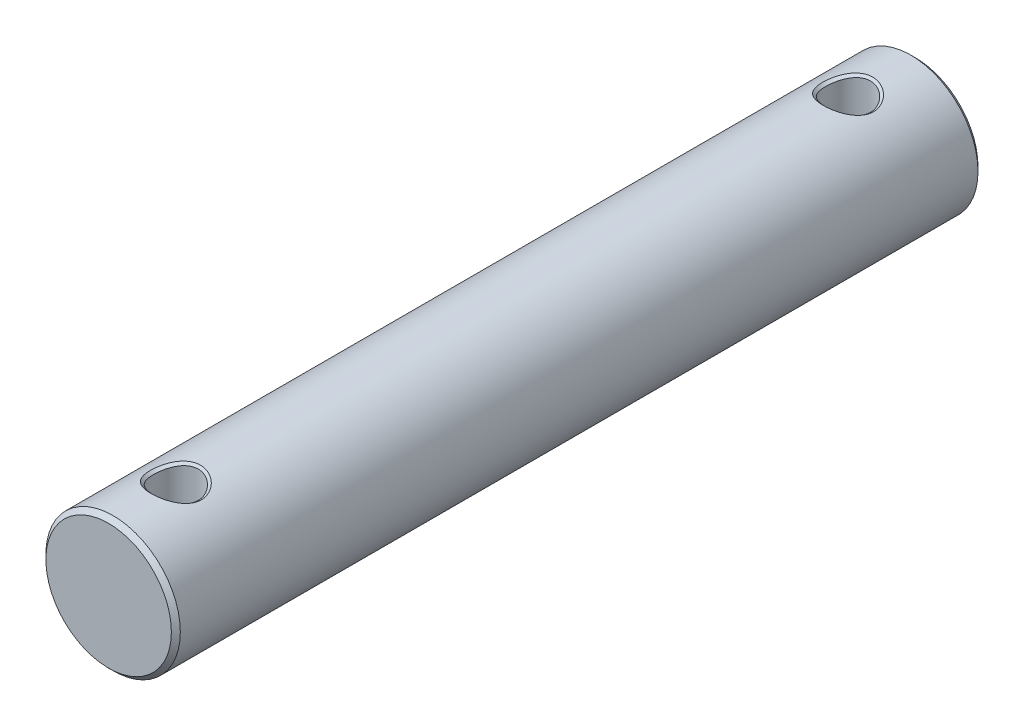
ISO-10303-21;
HEADER;
FILE_DESCRIPTION(('STEP AP214'),'2;1');
FILE_NAME('part.step','',(''),(''),'','','');
FILE_SCHEMA(('AUTOMOTIVE_DESIGN { 1 0 10303 214 1 1 1 1 }'));
ENDSEC;
DATA;
#1=APPLICATION_CONTEXT('core data for automotive mechanical design processes');
#2=APPLICATION_PROTOCOL_DEFINITION('international standard','automotive_design',2000,#1);
#3=PRODUCT_CONTEXT('',#1,'mechanical');
#4=PRODUCT('Part','Part','',(#3));
#5=PRODUCT_RELATED_PRODUCT_CATEGORY('part','',(#4));
#6=PRODUCT_DEFINITION_FORMATION('','',#4);
#7=PRODUCT_DEFINITION_CONTEXT('part definition',#1,'design');
#8=PRODUCT_DEFINITION('design','',#6,#7);
#9=PRODUCT_DEFINITION_SHAPE('','',#8);
#10=(LENGTH_UNIT() NAMED_UNIT(*) SI_UNIT(.MILLI.,.METRE.));
#11=(NAMED_UNIT(*) PLANE_ANGLE_UNIT() SI_UNIT($,.RADIAN.));
#12=(NAMED_UNIT(*) SI_UNIT($,.STERADIAN.) SOLID_ANGLE_UNIT());
#13=UNCERTAINTY_MEASURE_WITH_UNIT(LENGTH_MEASURE(1.E-05),#10,'distance_accuracy_value','');
#14=(GEOMETRIC_REPRESENTATION_CONTEXT(3) GLOBAL_UNCERTAINTY_ASSIGNED_CONTEXT((#13)) GLOBAL_UNIT_ASSIGNED_CONTEXT((#10,
#11,#12)) REPRESENTATION_CONTEXT('',''));
#15=CARTESIAN_POINT('',(0.,0.,0.));
#16=DIRECTION('',(0.,0.,1.));
#17=DIRECTION('',(1.,0.,0.));
#18=AXIS2_PLACEMENT_3D('',#15,#16,#17);
#19=CARTESIAN_POINT('',(0.,0.,180.));
#20=DIRECTION('',(0.,0.,-1.));
#21=DIRECTION('',(-1.,0.,0.));
#22=AXIS2_PLACEMENT_3D('',#19,#20,#21);
#23=CYLINDRICAL_SURFACE('',#22,15.);
#24=CARTESIAN_POINT('',(0.,-15.,170.499999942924));
#25=CARTESIAN_POINT('',(-0.0942102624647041,-14.9999813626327,170.499940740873));
#26=CARTESIAN_POINT('',(-0.188413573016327,-14.9989718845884,170.497529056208));
#27=CARTESIAN_POINT('',(-0.376327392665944,-14.9950698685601,170.48808421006));
#28=CARTESIAN_POINT('',(-0.470038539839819,-14.9921817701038,170.48106194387));
#29=CARTESIAN_POINT('',(-0.656774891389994,-14.9846266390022,170.462494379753));
#30=CARTESIAN_POINT('',(-0.749800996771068,-14.9799626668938,170.450956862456));
#31=CARTESIAN_POINT('',(-0.934978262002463,-14.9689611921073,170.423459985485));
#32=CARTESIAN_POINT('',(-1.02713036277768,-14.96262576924,170.407506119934));
#33=CARTESIAN_POINT('',(-1.21036976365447,-14.9483859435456,170.37127592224));
#34=CARTESIAN_POINT('',(-1.30145795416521,-14.9404829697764,170.351003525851));
#35=CARTESIAN_POINT('',(-1.48238000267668,-14.9232124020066,170.306235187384));
#36=CARTESIAN_POINT('',(-1.57221470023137,-14.9138458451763,170.281742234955));
#37=CARTESIAN_POINT('',(-1.75044012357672,-14.8937521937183,170.228631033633));
#38=CARTESIAN_POINT('',(-1.83883170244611,-14.8830259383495,170.200015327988));
#39=CARTESIAN_POINT('',(-2.01398117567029,-14.8603167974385,170.138756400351));
#40=CARTESIAN_POINT('',(-2.10074004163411,-14.8483346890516,170.106115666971));
#41=CARTESIAN_POINT('',(-2.27243424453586,-14.82321763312,170.036904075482));
#42=CARTESIAN_POINT('',(-2.35737079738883,-14.8100834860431,170.000335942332));
#43=CARTESIAN_POINT('',(-2.52523038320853,-14.7827660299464,169.923366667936));
#44=CARTESIAN_POINT('',(-2.60815500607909,-14.7685835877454,169.882968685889));
#45=CARTESIAN_POINT('',(-2.77180061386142,-14.7392733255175,169.798436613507));
#46=CARTESIAN_POINT('',(-2.8525236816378,-14.7241464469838,169.754306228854));
#47=CARTESIAN_POINT('',(-3.01157587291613,-14.6930505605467,169.662406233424));
#48=CARTESIAN_POINT('',(-3.08990766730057,-14.6770825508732,169.614640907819));
#49=CARTESIAN_POINT('',(-3.24398712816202,-14.6444096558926,169.51556754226));
#50=CARTESIAN_POINT('',(-3.31973811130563,-14.6277057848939,169.464264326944));
#51=CARTESIAN_POINT('',(-3.46846487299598,-14.5936590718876,169.358212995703));
#52=CARTESIAN_POINT('',(-3.54144462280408,-14.5763172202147,169.303470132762));
#53=CARTESIAN_POINT('',(-3.68444093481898,-14.5411200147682,169.190632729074));
#54=CARTESIAN_POINT('',(-3.75446206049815,-14.5232655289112,169.132543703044));
#55=CARTESIAN_POINT('',(-3.89134165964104,-14.4870661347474,169.01312486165));
#56=CARTESIAN_POINT('',(-3.95820516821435,-14.468722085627,168.951800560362));
#57=CARTESIAN_POINT('',(-4.08862078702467,-14.4319459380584,168.825949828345));
#58=CARTESIAN_POINT('',(-4.15217772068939,-14.4135140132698,168.761428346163));
#59=CARTESIAN_POINT('',(-4.2759216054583,-14.3769871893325,168.629310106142));
#60=CARTESIAN_POINT('',(-4.3361129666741,-14.3588918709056,168.561717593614));
#61=CARTESIAN_POINT('',(-4.45301567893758,-14.3230838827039,168.423655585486));
#62=CARTESIAN_POINT('',(-4.50973167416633,-14.3053707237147,168.353190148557));
#63=CARTESIAN_POINT('',(-4.61958483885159,-14.270474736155,168.209562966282));
#64=CARTESIAN_POINT('',(-4.67272703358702,-14.2532911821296,168.136405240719));
#65=CARTESIAN_POINT('',(-4.77533055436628,-14.2195748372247,167.987578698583));
#66=CARTESIAN_POINT('',(-4.82479739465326,-14.2030410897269,167.911913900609));
#67=CARTESIAN_POINT('',(-4.91994887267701,-14.1707521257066,167.758257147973));
#68=CARTESIAN_POINT('',(-4.96563954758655,-14.1549956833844,167.680269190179));
#69=CARTESIAN_POINT('',(-5.05313710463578,-14.1243871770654,167.522150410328));
#70=CARTESIAN_POINT('',(-5.0949505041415,-14.1095336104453,167.442023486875));
#71=CARTESIAN_POINT('',(-5.17459202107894,-14.0808572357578,167.279811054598));
#72=CARTESIAN_POINT('',(-5.21242700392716,-14.0670326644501,167.197729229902));
#73=CARTESIAN_POINT('',(-5.28401031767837,-14.0405405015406,167.031791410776));
#74=CARTESIAN_POINT('',(-5.31776562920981,-14.0278709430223,166.947938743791));
#75=CARTESIAN_POINT('',(-5.38108846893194,-14.003815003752,166.778643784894));
#76=CARTESIAN_POINT('',(-5.4106627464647,-13.9924265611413,166.693204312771));
#77=CARTESIAN_POINT('',(-5.46552275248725,-13.971058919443,166.52092043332));
#78=CARTESIAN_POINT('',(-5.49081452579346,-13.9610777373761,166.434078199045));
#79=CARTESIAN_POINT('',(-5.53700919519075,-13.94265052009,166.259173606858));
#80=CARTESIAN_POINT('',(-5.55791681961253,-13.9342028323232,166.17111267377));
#81=CARTESIAN_POINT('',(-5.59524366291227,-13.9189681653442,165.993955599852));
#82=CARTESIAN_POINT('',(-5.61166553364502,-13.9121802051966,165.904860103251));
#83=CARTESIAN_POINT('',(-5.63992146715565,-13.900390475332,165.725818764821));
#84=CARTESIAN_POINT('',(-5.65175519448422,-13.895388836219,165.635872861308));
#85=CARTESIAN_POINT('',(-5.67073879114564,-13.8872957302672,165.455315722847));
#86=CARTESIAN_POINT('',(-5.67788428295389,-13.8842060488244,165.364703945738));
#87=CARTESIAN_POINT('',(-5.68738736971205,-13.8800641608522,165.182998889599));
#88=CARTESIAN_POINT('',(-5.68973534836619,-13.8790160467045,165.091905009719));
#89=CARTESIAN_POINT('',(-5.6895747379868,-13.879069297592,164.909728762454));
#90=CARTESIAN_POINT('',(-5.6870664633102,-13.8801705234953,164.818646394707));
#91=CARTESIAN_POINT('',(-5.67729287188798,-13.8843977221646,164.636982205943));
#92=CARTESIAN_POINT('',(-5.67003773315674,-13.8875193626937,164.546399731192));
#93=CARTESIAN_POINT('',(-5.65086737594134,-13.8956634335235,164.36591503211));
#94=CARTESIAN_POINT('',(-5.63895715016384,-13.9006838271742,164.276012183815));
#95=CARTESIAN_POINT('',(-5.61058134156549,-13.9124983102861,164.097066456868));
#96=CARTESIAN_POINT('',(-5.59411667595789,-13.9192920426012,164.008023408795));
#97=CARTESIAN_POINT('',(-5.55673318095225,-13.9345277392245,163.830976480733));
#98=CARTESIAN_POINT('',(-5.53581220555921,-13.9429704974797,163.742973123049));
#99=CARTESIAN_POINT('',(-5.4896169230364,-13.9613790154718,163.568184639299));
#100=CARTESIAN_POINT('',(-5.46433828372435,-13.9713462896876,163.481400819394));
#101=CARTESIAN_POINT('',(-5.4095274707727,-13.9926790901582,163.309230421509));
#102=CARTESIAN_POINT('',(-5.37998951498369,-14.0040465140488,163.223845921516));
#103=CARTESIAN_POINT('',(-5.31675919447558,-14.028055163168,163.054653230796));
#104=CARTESIAN_POINT('',(-5.28306019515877,-14.0406984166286,162.970847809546));
#105=CARTESIAN_POINT('',(-5.21160631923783,-14.0671345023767,162.80499245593));
#106=CARTESIAN_POINT('',(-5.1738444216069,-14.0809293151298,162.722945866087));
#107=CARTESIAN_POINT('',(-5.09436284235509,-14.1095444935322,162.560787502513));
#108=CARTESIAN_POINT('',(-5.05263609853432,-14.1243666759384,162.480679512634));
#109=CARTESIAN_POINT('',(-4.96532255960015,-14.1549125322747,162.322577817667));
#110=CARTESIAN_POINT('',(-4.91972889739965,-14.1706377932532,162.24458821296));
#111=CARTESIAN_POINT('',(-4.82477913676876,-14.2028663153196,162.090902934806));
#112=CARTESIAN_POINT('',(-4.77541650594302,-14.2193709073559,162.015211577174));
#113=CARTESIAN_POINT('',(-4.67302589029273,-14.2530326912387,161.866302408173));
#114=CARTESIAN_POINT('',(-4.61999176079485,-14.2701909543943,161.793089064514));
#115=CARTESIAN_POINT('',(-4.51035668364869,-14.3050418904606,161.649316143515));
#116=CARTESIAN_POINT('',(-4.45374996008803,-14.3227354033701,161.578761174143));
#117=CARTESIAN_POINT('',(-4.3370626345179,-14.3585116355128,161.440483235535));
#118=CARTESIAN_POINT('',(-4.27697652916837,-14.3765949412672,161.372765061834));
#119=CARTESIAN_POINT('',(-4.15344449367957,-14.4131065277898,161.240346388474));
#120=CARTESIAN_POINT('',(-4.08999322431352,-14.4315353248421,161.175651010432));
#121=CARTESIAN_POINT('',(-3.95977244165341,-14.4683140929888,161.049441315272));
#122=CARTESIAN_POINT('',(-3.89299773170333,-14.4866638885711,160.987932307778));
#123=CARTESIAN_POINT('',(-3.75626543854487,-14.5228805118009,160.86817588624));
#124=CARTESIAN_POINT('',(-3.68630295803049,-14.540746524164,160.809933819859));
#125=CARTESIAN_POINT('',(-3.54340265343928,-14.5759709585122,160.696812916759));
#126=CARTESIAN_POINT('',(-3.47046032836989,-14.593328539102,160.641939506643));
#127=CARTESIAN_POINT('',(-3.32178672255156,-14.6274099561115,160.535650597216));
#128=CARTESIAN_POINT('',(-3.24605146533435,-14.644132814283,160.484240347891));
#129=CARTESIAN_POINT('',(-3.09198385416,-14.6768458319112,160.384974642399));
#130=CARTESIAN_POINT('',(-3.01364813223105,-14.6928349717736,160.337124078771));
#131=CARTESIAN_POINT('',(-2.85456988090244,-14.7239742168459,160.245074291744));
#132=CARTESIAN_POINT('',(-2.77382459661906,-14.7391233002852,160.200879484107));
#133=CARTESIAN_POINT('',(-2.61011791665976,-14.7684780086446,160.116238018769));
#134=CARTESIAN_POINT('',(-2.52715433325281,-14.7826826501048,160.07579525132));
#135=CARTESIAN_POINT('',(-2.35920169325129,-14.8100434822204,159.998754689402));
#136=CARTESIAN_POINT('',(-2.27421093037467,-14.823198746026,159.962160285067));
#137=CARTESIAN_POINT('',(-2.10239468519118,-14.8483559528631,159.892913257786));
#138=CARTESIAN_POINT('',(-2.01556786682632,-14.8603570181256,159.860263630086));
#139=CARTESIAN_POINT('',(-1.84027036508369,-14.8831009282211,159.799002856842));
#140=CARTESIAN_POINT('',(-1.75179859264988,-14.8938429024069,159.770394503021));
#141=CARTESIAN_POINT('',(-1.57340215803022,-14.9139637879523,159.717312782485));
#142=CARTESIAN_POINT('',(-1.48347653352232,-14.9233417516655,159.692842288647));
#143=CARTESIAN_POINT('',(-1.3023634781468,-14.9406298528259,159.648132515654));
#144=CARTESIAN_POINT('',(-1.2111751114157,-14.9485388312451,159.627896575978));
#145=CARTESIAN_POINT('',(-1.02772775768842,-14.962784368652,159.59175170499));
#146=CARTESIAN_POINT('',(-0.935467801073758,-14.9691193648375,159.575847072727));
#147=CARTESIAN_POINT('',(-0.750068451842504,-14.9801124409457,159.548460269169));
#148=CARTESIAN_POINT('',(-0.656928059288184,-14.9847682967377,159.536983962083));
#149=CARTESIAN_POINT('',(-0.469959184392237,-14.9922992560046,159.518548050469));
#150=CARTESIAN_POINT('',(-0.376129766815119,-14.9951711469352,159.51159659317));
#151=CARTESIAN_POINT('',(-0.187973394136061,-14.9990292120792,159.50230612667));
#152=CARTESIAN_POINT('',(-0.0936457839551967,-15.0000107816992,159.499978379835));
#153=CARTESIAN_POINT('',(0.0949994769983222,-14.9999891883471,159.500021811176));
#154=CARTESIAN_POINT('',(0.189317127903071,-14.998986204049,159.502392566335));
#155=CARTESIAN_POINT('',(0.377435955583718,-14.9950930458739,159.511757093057));
#156=CARTESIAN_POINT('',(0.471237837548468,-14.9922077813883,159.51873883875));
#157=CARTESIAN_POINT('',(0.658136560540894,-14.9846549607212,159.537227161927));
#158=CARTESIAN_POINT('',(0.751234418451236,-14.9799908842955,159.548724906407));
#159=CARTESIAN_POINT('',(0.936536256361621,-14.9689863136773,159.576145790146));
#160=CARTESIAN_POINT('',(1.02874133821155,-14.962648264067,159.592062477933));
#161=CARTESIAN_POINT('',(1.21206912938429,-14.9484008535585,159.628223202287));
#162=CARTESIAN_POINT('',(1.30319291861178,-14.9404932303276,159.648462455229));
#163=CARTESIAN_POINT('',(1.48416965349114,-14.9232115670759,159.693170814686));
#164=CARTESIAN_POINT('',(1.57402364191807,-14.9138388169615,159.717636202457));
#165=CARTESIAN_POINT('',(1.75227229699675,-14.8937315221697,159.770699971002));
#166=CARTESIAN_POINT('',(1.84066801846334,-14.8829980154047,159.79929520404));
#167=CARTESIAN_POINT('',(2.01581158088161,-14.86027365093,159.860522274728));
#168=CARTESIAN_POINT('',(2.10256057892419,-14.8482837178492,159.893151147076));
#169=CARTESIAN_POINT('',(2.2742220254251,-14.8231508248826,159.962349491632));
#170=CARTESIAN_POINT('',(2.35913584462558,-14.8100087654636,159.998915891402));
#171=CARTESIAN_POINT('',(2.52693812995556,-14.7826758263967,160.075893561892));
#172=CARTESIAN_POINT('',(2.60982829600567,-14.7684858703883,160.116301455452));
#173=CARTESIAN_POINT('',(2.77339436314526,-14.7391614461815,160.200866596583));
#174=CARTESIAN_POINT('',(2.85407239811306,-14.7240279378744,160.245020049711));
#175=CARTESIAN_POINT('',(3.01302510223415,-14.6929201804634,160.336980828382));
#176=CARTESIAN_POINT('',(3.09130241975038,-14.6769469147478,160.384783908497));
#177=CARTESIAN_POINT('',(3.24526478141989,-14.6442653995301,160.48394876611));
#178=CARTESIAN_POINT('',(3.32095303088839,-14.6275581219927,160.535305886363));
#179=CARTESIAN_POINT('',(3.46954726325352,-14.59350703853,160.641482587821));
#180=CARTESIAN_POINT('',(3.54245700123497,-14.576164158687,160.69629720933));
#181=CARTESIAN_POINT('',(3.68530810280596,-14.5409676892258,160.809296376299));
#182=CARTESIAN_POINT('',(3.75525369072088,-14.5231148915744,160.867475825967));
#183=CARTESIAN_POINT('',(3.89197603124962,-14.4869227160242,160.987097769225));
#184=CARTESIAN_POINT('',(3.95875734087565,-14.4685841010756,161.04853528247));
#185=CARTESIAN_POINT('',(4.08901280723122,-14.4318209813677,161.174626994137));
#186=CARTESIAN_POINT('',(4.15249111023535,-14.4133966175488,161.239276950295));
#187=CARTESIAN_POINT('',(4.27609210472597,-14.3768842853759,161.371656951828));
#188=CARTESIAN_POINT('',(4.33621848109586,-14.3587959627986,161.439383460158));
#189=CARTESIAN_POINT('',(4.45300259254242,-14.3230017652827,161.57771896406));
#190=CARTESIAN_POINT('',(4.50966430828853,-14.3052954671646,161.648324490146));
#191=CARTESIAN_POINT('',(4.61942023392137,-14.2704127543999,161.792234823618));
#192=CARTESIAN_POINT('',(4.67251887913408,-14.2532356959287,161.865536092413));
#193=CARTESIAN_POINT('',(4.77504576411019,-14.2195318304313,162.014651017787));
#194=CARTESIAN_POINT('',(4.82447901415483,-14.2030041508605,162.09046103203));
#195=CARTESIAN_POINT('',(4.91957311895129,-14.1707267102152,162.244407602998));
#196=CARTESIAN_POINT('',(4.96523960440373,-14.1549758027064,162.322540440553));
#197=CARTESIAN_POINT('',(5.05269786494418,-14.1243776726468,162.480946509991));
#198=CARTESIAN_POINT('',(5.09449586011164,-14.1095290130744,162.561216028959));
#199=CARTESIAN_POINT('',(5.17411492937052,-14.0808616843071,162.723709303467));
#200=CARTESIAN_POINT('',(5.21194269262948,-14.0670412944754,162.805929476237));
#201=CARTESIAN_POINT('',(5.28351919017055,-14.040556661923,162.972137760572));
#202=CARTESIAN_POINT('',(5.31727486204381,-14.0278904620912,163.056122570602));
#203=CARTESIAN_POINT('',(5.38060529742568,-14.0038403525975,163.225673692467));
#204=CARTESIAN_POINT('',(5.41018691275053,-13.9924543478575,163.311237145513));
#205=CARTESIAN_POINT('',(5.46506770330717,-13.9710906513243,163.483758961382));
#206=CARTESIAN_POINT('',(5.4903731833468,-13.9611108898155,163.570715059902));
#207=CARTESIAN_POINT('',(5.53660061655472,-13.9426855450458,163.745835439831));
#208=CARTESIAN_POINT('',(5.5575277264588,-13.9342381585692,163.83399816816));
#209=CARTESIAN_POINT('',(5.59489804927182,-13.9190031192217,164.01134496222));
#210=CARTESIAN_POINT('',(5.61134451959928,-13.912214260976,164.1005282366));
#211=CARTESIAN_POINT('',(5.63965358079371,-13.9004216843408,164.279729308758));
#212=CARTESIAN_POINT('',(5.65151662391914,-13.8954177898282,164.369747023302));
#213=CARTESIAN_POINT('',(5.67056118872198,-13.8873193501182,164.550430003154));
#214=CARTESIAN_POINT('',(5.67773930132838,-13.8842261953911,164.641095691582));
#215=CARTESIAN_POINT('',(5.68731214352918,-13.8800756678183,164.822888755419));
#216=CARTESIAN_POINT('',(5.68969840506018,-13.8790218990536,164.914016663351));
#217=CARTESIAN_POINT('',(5.6896068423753,-13.8790654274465,165.096236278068));
#218=CARTESIAN_POINT('',(5.68713077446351,-13.880161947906,165.187327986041));
#219=CARTESIAN_POINT('',(5.6774042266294,-13.8843842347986,165.368983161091));
#220=CARTESIAN_POINT('',(5.67016543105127,-13.887505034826,165.4595473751));
#221=CARTESIAN_POINT('',(5.65101540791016,-13.8956504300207,165.639970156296));
#222=CARTESIAN_POINT('',(5.63911042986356,-13.9006724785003,165.72982950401));
#223=CARTESIAN_POINT('',(5.61073398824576,-13.9124929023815,165.908665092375));
#224=CARTESIAN_POINT('',(5.59426446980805,-13.9192905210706,165.997641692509));
#225=CARTESIAN_POINT('',(5.55686235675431,-13.9345359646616,166.174534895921));
#226=CARTESIAN_POINT('',(5.5359284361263,-13.9429842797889,166.262451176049));
#227=CARTESIAN_POINT('',(5.48970027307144,-13.9614053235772,166.437047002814));
#228=CARTESIAN_POINT('',(5.46440233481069,-13.9713793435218,166.523725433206));
#229=CARTESIAN_POINT('',(5.40954790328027,-13.9927264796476,166.69566889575));
#230=CARTESIAN_POINT('',(5.37998610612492,-14.0041013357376,166.780932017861));
#231=CARTESIAN_POINT('',(5.31670500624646,-14.0281251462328,166.949868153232));
#232=CARTESIAN_POINT('',(5.28297941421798,-14.0407760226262,167.033538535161));
#233=CARTESIAN_POINT('',(5.21147116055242,-14.0672271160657,167.199112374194));
#234=CARTESIAN_POINT('',(5.17368171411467,-14.0810292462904,167.281012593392));
#235=CARTESIAN_POINT('',(5.09414572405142,-14.1096582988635,167.442869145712));
#236=CARTESIAN_POINT('',(5.05239226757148,-14.1244869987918,167.522821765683));
#237=CARTESIAN_POINT('',(4.96502784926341,-14.1550446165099,167.680606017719));
#238=CARTESIAN_POINT('',(4.9194101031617,-14.1707751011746,167.75843358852));
#239=CARTESIAN_POINT('',(4.82441655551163,-14.2030122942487,167.911790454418));
#240=CARTESIAN_POINT('',(4.77503425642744,-14.2195203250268,167.987315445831));
#241=CARTESIAN_POINT('',(4.67261051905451,-14.2531867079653,168.135889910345));
#242=CARTESIAN_POINT('',(4.61956294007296,-14.2703461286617,168.208934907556));
#243=CARTESIAN_POINT('',(4.50990893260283,-14.3051966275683,168.352371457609));
#244=CARTESIAN_POINT('',(4.45329671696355,-14.3228885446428,168.422758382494));
#245=CARTESIAN_POINT('',(4.33660835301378,-14.3586582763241,168.560703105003));
#246=CARTESIAN_POINT('',(4.27652668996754,-14.3767366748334,168.62825608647));
#247=CARTESIAN_POINT('',(4.15301455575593,-14.4132349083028,168.760348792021));
#248=CARTESIAN_POINT('',(4.08957874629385,-14.4316552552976,168.824883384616));
#249=CARTESIAN_POINT('',(3.95938994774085,-14.468416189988,168.950795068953));
#250=CARTESIAN_POINT('',(3.89263108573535,-14.4867565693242,169.012166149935));
#251=CARTESIAN_POINT('',(3.7559221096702,-14.5229568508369,169.131685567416));
#252=CARTESIAN_POINT('',(3.68596593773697,-14.540815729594,169.189827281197));
#253=CARTESIAN_POINT('',(3.54307124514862,-14.5760283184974,169.302781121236));
#254=CARTESIAN_POINT('',(3.47012733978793,-14.5933810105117,169.357586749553));
#255=CARTESIAN_POINT('',(3.32144584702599,-14.6274546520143,169.463769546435));
#256=CARTESIAN_POINT('',(3.24570363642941,-14.6441744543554,169.515140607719));
#257=CARTESIAN_POINT('',(3.09161947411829,-14.6768830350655,169.614352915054));
#258=CARTESIAN_POINT('',(3.01327371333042,-14.6928706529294,169.662188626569));
#259=CARTESIAN_POINT('',(2.8541749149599,-14.7240081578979,169.754229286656));
#260=CARTESIAN_POINT('',(2.77341885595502,-14.7391569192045,169.798429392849));
#261=CARTESIAN_POINT('',(2.60969234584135,-14.7685119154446,169.883097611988));
#262=CARTESIAN_POINT('',(2.52671958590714,-14.7827171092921,169.923561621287));
#263=CARTESIAN_POINT('',(2.35875253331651,-14.8100795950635,170.000656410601));
#264=CARTESIAN_POINT('',(2.27375653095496,-14.8232359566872,170.037283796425));
#265=CARTESIAN_POINT('',(2.10193599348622,-14.8483955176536,170.10660411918));
#266=CARTESIAN_POINT('',(2.01511020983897,-14.8603978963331,170.139294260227));
#267=CARTESIAN_POINT('',(1.83982323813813,-14.883144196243,170.200638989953));
#268=CARTESIAN_POINT('',(1.75136111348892,-14.8938873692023,170.229291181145));
#269=CARTESIAN_POINT('',(1.57299472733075,-14.9140100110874,170.282459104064));
#270=CARTESIAN_POINT('',(1.48308969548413,-14.9233887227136,170.306972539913));
#271=CARTESIAN_POINT('',(1.30203091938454,-14.9406772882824,170.351762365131));
#272=CARTESIAN_POINT('',(1.21087644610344,-14.9485862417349,170.372036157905));
#273=CARTESIAN_POINT('',(1.02751224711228,-14.9628302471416,170.408246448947));
#274=CARTESIAN_POINT('',(0.935301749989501,-14.969164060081,170.424179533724));
#275=CARTESIAN_POINT('',(0.750019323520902,-14.9801530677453,170.45160894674));
#276=CARTESIAN_POINT('',(0.656946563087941,-14.9848064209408,170.463100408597));
#277=CARTESIAN_POINT('',(0.47013234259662,-14.9923296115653,170.481546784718));
#278=CARTESIAN_POINT('',(0.376390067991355,-14.9951966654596,170.488494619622));
#279=CARTESIAN_POINT('',(0.188433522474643,-14.9990444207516,170.497758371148));
#280=CARTESIAN_POINT('',(0.0942186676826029,-15.0000209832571,170.500064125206));
#281=CARTESIAN_POINT('',(0.,-15.,170.499999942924));
#282=B_SPLINE_CURVE_WITH_KNOTS('',3,(#24,#25,#26,#27,#28,#29,#30,#31,#32,#33,#34,#35,#36,#37,
#38,#39,#40,#41,#42,#43,#44,#45,#46,#47,#48,#49,#50,#51,#52,#53,#54,#55,#56,#57,#58,#59,#60,#61,
#62,#63,#64,#65,#66,#67,#68,#69,#70,#71,#72,#73,#74,#75,#76,#77,#78,#79,#80,#81,#82,#83,#84,#85,
#86,#87,#88,#89,#90,#91,#92,#93,#94,#95,#96,#97,#98,#99,#100,#101,#102,#103,#104,#105,#106,#107,
#108,#109,#110,#111,#112,#113,#114,#115,#116,#117,#118,#119,#120,#121,#122,#123,#124,#125,#126,
#127,#128,#129,#130,#131,#132,#133,#134,#135,#136,#137,#138,#139,#140,#141,#142,#143,#144,#145,
#146,#147,#148,#149,#150,#151,#152,#153,#154,#155,#156,#157,#158,#159,#160,#161,#162,#163,#164,
#165,#166,#167,#168,#169,#170,#171,#172,#173,#174,#175,#176,#177,#178,#179,#180,#181,#182,#183,
#184,#185,#186,#187,#188,#189,#190,#191,#192,#193,#194,#195,#196,#197,#198,#199,#200,#201,#202,
#203,#204,#205,#206,#207,#208,#209,#210,#211,#212,#213,#214,#215,#216,#217,#218,#219,#220,#221,
#222,#223,#224,#225,#226,#227,#228,#229,#230,#231,#232,#233,#234,#235,#236,#237,#238,#239,#240,
#241,#242,#243,#244,#245,#246,#247,#248,#249,#250,#251,#252,#253,#254,#255,#256,#257,#258,#259,
#260,#261,#262,#263,#264,#265,#266,#267,#268,#269,#270,#271,#272,#273,#274,#275,#276,#277,#278,
#279,#280,#281),.UNSPECIFIED.,.F.,.F.,(4,2,2,2,2,2,2,2,2,2,2,2,2,2,2,2,2,2,2,2,2,2,2,2,2,2,2,2,
2,2,2,2,2,2,2,2,2,2,2,2,2,2,2,2,2,2,2,2,2,2,2,2,2,2,2,2,2,2,2,2,2,2,2,2,2,2,2,2,2,2,2,2,2,2,2,2,
2,2,2,2,2,2,2,2,2,2,2,2,2,2,2,2,2,2,2,2,2,2,2,2,2,2,2,2,2,2,2,2,2,2,2,2,2,2,2,2,2,2,2,2,2,2,2,2,
2,2,2,2,4),(0.,0.282588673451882,0.564511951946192,0.845951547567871,1.12704258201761,
1.40787852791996,1.68851635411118,1.96898179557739,2.24927469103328,2.52937435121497,
2.80924493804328,3.08884084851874,3.36811210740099,3.64700977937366,3.92549141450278,
4.20352654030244,4.48110220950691,4.75826091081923,5.03504748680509,5.31145573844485,
5.58746682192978,5.86305506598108,6.13819382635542,6.41286138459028,6.68704689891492,
6.96075641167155,7.23401890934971,7.5068924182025,7.77947010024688,8.05188629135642,
8.3243223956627,8.59701251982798,8.87024869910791,9.14346719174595,9.4161017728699,
9.68844474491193,9.96073291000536,10.2331524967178,10.5058444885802,10.778910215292,
11.0524170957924,11.3264044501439,11.6008893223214,11.8758722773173,12.1513431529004,
12.4272867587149,12.7036885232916,12.9805400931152,13.2578448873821,13.5355978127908,
13.8137928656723,14.0924249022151,14.371470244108,14.6508922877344,14.9306470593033,
15.2106887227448,15.490975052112,15.771472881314,16.0521635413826,16.3330482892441,
16.6141537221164,16.8955371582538,17.1772919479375,17.4595526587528,17.7425000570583,
18.0254219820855,18.3076089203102,18.5892466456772,18.8704753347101,19.1513943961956,
19.4320675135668,19.7125278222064,19.9927831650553,20.2728213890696,20.5526156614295,
20.8321297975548,21.111323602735,21.3901582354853,21.6686016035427,21.9466338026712,
22.2242526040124,22.5015140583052,22.7784644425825,23.0550904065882,23.33136538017,
23.6072554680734,23.8827253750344,24.1577443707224,24.4322923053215,24.7063656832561,
24.9799837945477,25.2531948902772,25.5260823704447,25.7987709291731,26.0714325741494,
26.3442924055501,26.6176340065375,26.8908768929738,27.1634519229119,27.4356631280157,
27.7077585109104,27.9799348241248,28.2523427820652,28.5250925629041,28.7982594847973,
29.0718897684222,29.3460063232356,29.6206145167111,29.8957079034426,30.1712739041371,
30.4472994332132,30.7237764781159,31.0007076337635,31.2781469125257,31.5561356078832,
31.8346494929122,32.1136461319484,32.3930706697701,32.6728615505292,32.9529561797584,
33.2332965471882,33.5138348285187,33.7945389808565,34.0753983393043,34.356429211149,
34.6376804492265,34.9192389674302,35.2012351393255,35.4838479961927),.UNSPECIFIED.);
#283=CARTESIAN_POINT('',(0.,-15.,170.499999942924));
#284=VERTEX_POINT('',#283);
#285=EDGE_CURVE('E56',#284,#284,#282,.F.);
#286=ORIENTED_EDGE('',*,*,#285,.T.);
#287=EDGE_LOOP('',(#286));
#288=FACE_BOUND('',#287,.T.);
#289=CARTESIAN_POINT('',(0.,15.,170.499999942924));
#290=CARTESIAN_POINT('',(0.0942102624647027,14.9999813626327,170.499940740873));
#291=CARTESIAN_POINT('',(0.188413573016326,14.9989718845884,170.497529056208));
#292=CARTESIAN_POINT('',(0.376327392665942,14.9950698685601,170.48808421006));
#293=CARTESIAN_POINT('',(0.470038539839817,14.9921817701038,170.48106194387));
#294=CARTESIAN_POINT('',(0.656774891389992,14.9846266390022,170.462494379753));
#295=CARTESIAN_POINT('',(0.749800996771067,14.9799626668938,170.450956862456));
#296=CARTESIAN_POINT('',(0.934978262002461,14.9689611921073,170.423459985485));
#297=CARTESIAN_POINT('',(1.02713036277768,14.96262576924,170.407506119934));
#298=CARTESIAN_POINT('',(1.21036976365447,14.9483859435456,170.37127592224));
#299=CARTESIAN_POINT('',(1.30145795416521,14.9404829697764,170.351003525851));
#300=CARTESIAN_POINT('',(1.48238000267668,14.9232124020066,170.306235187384));
#301=CARTESIAN_POINT('',(1.57221470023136,14.9138458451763,170.281742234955));
#302=CARTESIAN_POINT('',(1.75044012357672,14.8937521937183,170.228631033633));
#303=CARTESIAN_POINT('',(1.8388317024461,14.8830259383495,170.200015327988));
#304=CARTESIAN_POINT('',(2.01398117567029,14.8603167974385,170.138756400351));
#305=CARTESIAN_POINT('',(2.10074004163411,14.8483346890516,170.106115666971));
#306=CARTESIAN_POINT('',(2.27243424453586,14.82321763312,170.036904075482));
#307=CARTESIAN_POINT('',(2.35737079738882,14.8100834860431,170.000335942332));
#308=CARTESIAN_POINT('',(2.52523038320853,14.7827660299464,169.923366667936));
#309=CARTESIAN_POINT('',(2.60815500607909,14.7685835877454,169.882968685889));
#310=CARTESIAN_POINT('',(2.77180061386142,14.7392733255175,169.798436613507));
#311=CARTESIAN_POINT('',(2.8525236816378,14.7241464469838,169.754306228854));
#312=CARTESIAN_POINT('',(3.01157587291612,14.6930505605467,169.662406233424));
#313=CARTESIAN_POINT('',(3.08990766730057,14.6770825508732,169.614640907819));
#314=CARTESIAN_POINT('',(3.24398712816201,14.6444096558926,169.51556754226));
#315=CARTESIAN_POINT('',(3.31973811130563,14.6277057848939,169.464264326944));
#316=CARTESIAN_POINT('',(3.46846487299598,14.5936590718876,169.358212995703));
#317=CARTESIAN_POINT('',(3.54144462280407,14.5763172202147,169.303470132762));
#318=CARTESIAN_POINT('',(3.68444093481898,14.5411200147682,169.190632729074));
#319=CARTESIAN_POINT('',(3.75446206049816,14.5232655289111,169.132543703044));
#320=CARTESIAN_POINT('',(3.89134165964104,14.4870661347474,169.01312486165));
#321=CARTESIAN_POINT('',(3.95820516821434,14.468722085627,168.951800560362));
#322=CARTESIAN_POINT('',(4.08862078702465,14.4319459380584,168.825949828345));
#323=CARTESIAN_POINT('',(4.15217772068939,14.4135140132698,168.761428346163));
#324=CARTESIAN_POINT('',(4.27592160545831,14.3769871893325,168.629310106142));
#325=CARTESIAN_POINT('',(4.3361129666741,14.3588918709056,168.561717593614));
#326=CARTESIAN_POINT('',(4.45301567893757,14.3230838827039,168.423655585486));
#327=CARTESIAN_POINT('',(4.50973167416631,14.3053707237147,168.353190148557));
#328=CARTESIAN_POINT('',(4.61958483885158,14.270474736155,168.209562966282));
#329=CARTESIAN_POINT('',(4.67272703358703,14.2532911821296,168.13640524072));
#330=CARTESIAN_POINT('',(4.77533055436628,14.2195748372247,167.987578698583));
#331=CARTESIAN_POINT('',(4.82479739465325,14.2030410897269,167.911913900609));
#332=CARTESIAN_POINT('',(4.919948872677,14.1707521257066,167.758257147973));
#333=CARTESIAN_POINT('',(4.96563954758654,14.1549956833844,167.680269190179));
#334=CARTESIAN_POINT('',(5.05313710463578,14.1243871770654,167.522150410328));
#335=CARTESIAN_POINT('',(5.09495050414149,14.1095336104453,167.442023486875));
#336=CARTESIAN_POINT('',(5.17459202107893,14.0808572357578,167.279811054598));
#337=CARTESIAN_POINT('',(5.21242700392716,14.0670326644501,167.197729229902));
#338=CARTESIAN_POINT('',(5.28401031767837,14.0405405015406,167.031791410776));
#339=CARTESIAN_POINT('',(5.3177656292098,14.0278709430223,166.947938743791));
#340=CARTESIAN_POINT('',(5.38108846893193,14.003815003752,166.778643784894));
#341=CARTESIAN_POINT('',(5.41066274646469,13.9924265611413,166.693204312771));
#342=CARTESIAN_POINT('',(5.46552275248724,13.971058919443,166.52092043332));
#343=CARTESIAN_POINT('',(5.49081452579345,13.9610777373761,166.434078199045));
#344=CARTESIAN_POINT('',(5.53700919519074,13.94265052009,166.259173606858));
#345=CARTESIAN_POINT('',(5.55791681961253,13.9342028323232,166.171112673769));
#346=CARTESIAN_POINT('',(5.59524366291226,13.9189681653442,165.993955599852));
#347=CARTESIAN_POINT('',(5.61166553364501,13.9121802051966,165.904860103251));
#348=CARTESIAN_POINT('',(5.63992146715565,13.900390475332,165.725818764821));
#349=CARTESIAN_POINT('',(5.65175519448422,13.895388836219,165.635872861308));
#350=CARTESIAN_POINT('',(5.67073879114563,13.8872957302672,165.455315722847));
#351=CARTESIAN_POINT('',(5.67788428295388,13.8842060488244,165.364703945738));
#352=CARTESIAN_POINT('',(5.68738736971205,13.8800641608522,165.182998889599));
#353=CARTESIAN_POINT('',(5.68973534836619,13.8790160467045,165.091905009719));
#354=CARTESIAN_POINT('',(5.6895747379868,13.879069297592,164.909728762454));
#355=CARTESIAN_POINT('',(5.68706646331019,13.8801705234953,164.818646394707));
#356=CARTESIAN_POINT('',(5.67729287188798,13.8843977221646,164.636982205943));
#357=CARTESIAN_POINT('',(5.67003773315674,13.8875193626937,164.546399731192));
#358=CARTESIAN_POINT('',(5.65086737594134,13.8956634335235,164.36591503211));
#359=CARTESIAN_POINT('',(5.63895715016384,13.9006838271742,164.276012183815));
#360=CARTESIAN_POINT('',(5.61058134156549,13.9124983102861,164.097066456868));
#361=CARTESIAN_POINT('',(5.59411667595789,13.9192920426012,164.008023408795));
#362=CARTESIAN_POINT('',(5.55673318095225,13.9345277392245,163.830976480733));
#363=CARTESIAN_POINT('',(5.53581220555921,13.9429704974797,163.742973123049));
#364=CARTESIAN_POINT('',(5.48961692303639,13.9613790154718,163.568184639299));
#365=CARTESIAN_POINT('',(5.46433828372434,13.9713462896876,163.481400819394));
#366=CARTESIAN_POINT('',(5.4095274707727,13.9926790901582,163.309230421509));
#367=CARTESIAN_POINT('',(5.3799895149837,14.0040465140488,163.223845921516));
#368=CARTESIAN_POINT('',(5.31675919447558,14.028055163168,163.054653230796));
#369=CARTESIAN_POINT('',(5.28306019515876,14.0406984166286,162.970847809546));
#370=CARTESIAN_POINT('',(5.21160631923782,14.0671345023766,162.80499245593));
#371=CARTESIAN_POINT('',(5.1738444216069,14.0809293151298,162.722945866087));
#372=CARTESIAN_POINT('',(5.09436284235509,14.1095444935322,162.560787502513));
#373=CARTESIAN_POINT('',(5.05263609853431,14.1243666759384,162.480679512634));
#374=CARTESIAN_POINT('',(4.96532255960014,14.1549125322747,162.322577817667));
#375=CARTESIAN_POINT('',(4.91972889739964,14.1706377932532,162.24458821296));
#376=CARTESIAN_POINT('',(4.82477913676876,14.2028663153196,162.090902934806));
#377=CARTESIAN_POINT('',(4.77541650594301,14.2193709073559,162.015211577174));
#378=CARTESIAN_POINT('',(4.67302589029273,14.2530326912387,161.866302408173));
#379=CARTESIAN_POINT('',(4.61999176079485,14.2701909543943,161.793089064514));
#380=CARTESIAN_POINT('',(4.51035668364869,14.3050418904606,161.649316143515));
#381=CARTESIAN_POINT('',(4.45374996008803,14.3227354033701,161.578761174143));
#382=CARTESIAN_POINT('',(4.33706263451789,14.3585116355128,161.440483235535));
#383=CARTESIAN_POINT('',(4.27697652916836,14.3765949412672,161.372765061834));
#384=CARTESIAN_POINT('',(4.15344449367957,14.4131065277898,161.240346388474));
#385=CARTESIAN_POINT('',(4.08999322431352,14.4315353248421,161.175651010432));
#386=CARTESIAN_POINT('',(3.95977244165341,14.4683140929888,161.049441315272));
#387=CARTESIAN_POINT('',(3.89299773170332,14.4866638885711,160.987932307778));
#388=CARTESIAN_POINT('',(3.75626543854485,14.5228805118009,160.86817588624));
#389=CARTESIAN_POINT('',(3.68630295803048,14.540746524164,160.809933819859));
#390=CARTESIAN_POINT('',(3.54340265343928,14.5759709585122,160.696812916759));
#391=CARTESIAN_POINT('',(3.47046032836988,14.593328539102,160.641939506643));
#392=CARTESIAN_POINT('',(3.32178672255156,14.6274099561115,160.535650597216));
#393=CARTESIAN_POINT('',(3.24605146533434,14.644132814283,160.484240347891));
#394=CARTESIAN_POINT('',(3.09198385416,14.6768458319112,160.384974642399));
#395=CARTESIAN_POINT('',(3.01364813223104,14.6928349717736,160.337124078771));
#396=CARTESIAN_POINT('',(2.85456988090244,14.7239742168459,160.245074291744));
#397=CARTESIAN_POINT('',(2.77382459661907,14.7391233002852,160.200879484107));
#398=CARTESIAN_POINT('',(2.61011791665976,14.7684780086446,160.116238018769));
#399=CARTESIAN_POINT('',(2.5271543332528,14.7826826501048,160.07579525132));
#400=CARTESIAN_POINT('',(2.35920169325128,14.8100434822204,159.998754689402));
#401=CARTESIAN_POINT('',(2.27421093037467,14.823198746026,159.962160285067));
#402=CARTESIAN_POINT('',(2.10239468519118,14.8483559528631,159.892913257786));
#403=CARTESIAN_POINT('',(2.01556786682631,14.8603570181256,159.860263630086));
#404=CARTESIAN_POINT('',(1.84027036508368,14.8831009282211,159.799002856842));
#405=CARTESIAN_POINT('',(1.75179859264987,14.8938429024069,159.770394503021));
#406=CARTESIAN_POINT('',(1.57340215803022,14.9139637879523,159.717312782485));
#407=CARTESIAN_POINT('',(1.48347653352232,14.9233417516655,159.692842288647));
#408=CARTESIAN_POINT('',(1.3023634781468,14.9406298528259,159.648132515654));
#409=CARTESIAN_POINT('',(1.2111751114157,14.9485388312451,159.627896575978));
#410=CARTESIAN_POINT('',(1.02772775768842,14.962784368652,159.59175170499));
#411=CARTESIAN_POINT('',(0.935467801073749,14.9691193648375,159.575847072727));
#412=CARTESIAN_POINT('',(0.750068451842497,14.9801124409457,159.548460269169));
#413=CARTESIAN_POINT('',(0.656928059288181,14.9847682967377,159.536983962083));
#414=CARTESIAN_POINT('',(0.469959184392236,14.9922992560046,159.518548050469));
#415=CARTESIAN_POINT('',(0.376129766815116,14.9951711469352,159.51159659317));
#416=CARTESIAN_POINT('',(0.187973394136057,14.9990292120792,159.502306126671));
#417=CARTESIAN_POINT('',(0.0936457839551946,15.0000107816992,159.499978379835));
#418=CARTESIAN_POINT('',(-0.0949994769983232,14.9999891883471,159.500021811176));
#419=CARTESIAN_POINT('',(-0.189317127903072,14.998986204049,159.502392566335));
#420=CARTESIAN_POINT('',(-0.377435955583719,14.9950930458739,159.511757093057));
#421=CARTESIAN_POINT('',(-0.471237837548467,14.9922077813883,159.51873883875));
#422=CARTESIAN_POINT('',(-0.658136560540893,14.9846549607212,159.537227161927));
#423=CARTESIAN_POINT('',(-0.751234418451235,14.9799908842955,159.548724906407));
#424=CARTESIAN_POINT('',(-0.936536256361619,14.9689863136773,159.576145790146));
#425=CARTESIAN_POINT('',(-1.02874133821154,14.962648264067,159.592062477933));
#426=CARTESIAN_POINT('',(-1.21206912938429,14.9484008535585,159.628223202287));
#427=CARTESIAN_POINT('',(-1.30319291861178,14.9404932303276,159.648462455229));
#428=CARTESIAN_POINT('',(-1.48416965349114,14.9232115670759,159.693170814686));
#429=CARTESIAN_POINT('',(-1.57402364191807,14.9138388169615,159.717636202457));
#430=CARTESIAN_POINT('',(-1.75227229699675,14.8937315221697,159.770699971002));
#431=CARTESIAN_POINT('',(-1.84066801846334,14.8829980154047,159.79929520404));
#432=CARTESIAN_POINT('',(-2.0158115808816,14.86027365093,159.860522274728));
#433=CARTESIAN_POINT('',(-2.10256057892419,14.8482837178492,159.893151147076));
#434=CARTESIAN_POINT('',(-2.2742220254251,14.8231508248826,159.962349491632));
#435=CARTESIAN_POINT('',(-2.35913584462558,14.8100087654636,159.998915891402));
#436=CARTESIAN_POINT('',(-2.52693812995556,14.7826758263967,160.075893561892));
#437=CARTESIAN_POINT('',(-2.60982829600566,14.7684858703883,160.116301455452));
#438=CARTESIAN_POINT('',(-2.77339436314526,14.7391614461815,160.200866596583));
#439=CARTESIAN_POINT('',(-2.85407239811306,14.7240279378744,160.245020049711));
#440=CARTESIAN_POINT('',(-3.01302510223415,14.6929201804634,160.336980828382));
#441=CARTESIAN_POINT('',(-3.09130241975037,14.6769469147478,160.384783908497));
#442=CARTESIAN_POINT('',(-3.24526478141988,14.6442653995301,160.48394876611));
#443=CARTESIAN_POINT('',(-3.32095303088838,14.6275581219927,160.535305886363));
#444=CARTESIAN_POINT('',(-3.46954726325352,14.59350703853,160.641482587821));
#445=CARTESIAN_POINT('',(-3.54245700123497,14.576164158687,160.69629720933));
#446=CARTESIAN_POINT('',(-3.68530810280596,14.5409676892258,160.809296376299));
#447=CARTESIAN_POINT('',(-3.75525369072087,14.5231148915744,160.867475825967));
#448=CARTESIAN_POINT('',(-3.89197603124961,14.4869227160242,160.987097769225));
#449=CARTESIAN_POINT('',(-3.95875734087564,14.4685841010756,161.04853528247));
#450=CARTESIAN_POINT('',(-4.08901280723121,14.4318209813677,161.174626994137));
#451=CARTESIAN_POINT('',(-4.15249111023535,14.4133966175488,161.239276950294));
#452=CARTESIAN_POINT('',(-4.27609210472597,14.3768842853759,161.371656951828));
#453=CARTESIAN_POINT('',(-4.33621848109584,14.3587959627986,161.439383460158));
#454=CARTESIAN_POINT('',(-4.4530025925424,14.3230017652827,161.57771896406));
#455=CARTESIAN_POINT('',(-4.50966430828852,14.3052954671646,161.648324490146));
#456=CARTESIAN_POINT('',(-4.61942023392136,14.2704127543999,161.792234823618));
#457=CARTESIAN_POINT('',(-4.67251887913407,14.2532356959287,161.865536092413));
#458=CARTESIAN_POINT('',(-4.77504576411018,14.2195318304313,162.014651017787));
#459=CARTESIAN_POINT('',(-4.82447901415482,14.2030041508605,162.09046103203));
#460=CARTESIAN_POINT('',(-4.91957311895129,14.1707267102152,162.244407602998));
#461=CARTESIAN_POINT('',(-4.96523960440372,14.1549758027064,162.322540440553));
#462=CARTESIAN_POINT('',(-5.05269786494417,14.1243776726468,162.480946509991));
#463=CARTESIAN_POINT('',(-5.09449586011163,14.1095290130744,162.561216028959));
#464=CARTESIAN_POINT('',(-5.1741149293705,14.0808616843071,162.723709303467));
#465=CARTESIAN_POINT('',(-5.21194269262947,14.0670412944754,162.805929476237));
#466=CARTESIAN_POINT('',(-5.28351919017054,14.040556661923,162.972137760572));
#467=CARTESIAN_POINT('',(-5.31727486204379,14.0278904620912,163.056122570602));
#468=CARTESIAN_POINT('',(-5.38060529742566,14.0038403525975,163.225673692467));
#469=CARTESIAN_POINT('',(-5.41018691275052,13.9924543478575,163.311237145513));
#470=CARTESIAN_POINT('',(-5.46506770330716,13.9710906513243,163.483758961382));
#471=CARTESIAN_POINT('',(-5.49037318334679,13.9611108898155,163.570715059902));
#472=CARTESIAN_POINT('',(-5.53660061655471,13.9426855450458,163.745835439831));
#473=CARTESIAN_POINT('',(-5.55752772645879,13.9342381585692,163.83399816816));
#474=CARTESIAN_POINT('',(-5.59489804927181,13.9190031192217,164.01134496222));
#475=CARTESIAN_POINT('',(-5.61134451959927,13.912214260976,164.1005282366));
#476=CARTESIAN_POINT('',(-5.6396535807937,13.9004216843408,164.279729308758));
#477=CARTESIAN_POINT('',(-5.65151662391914,13.8954177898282,164.369747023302));
#478=CARTESIAN_POINT('',(-5.67056118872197,13.8873193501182,164.550430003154));
#479=CARTESIAN_POINT('',(-5.67773930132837,13.8842261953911,164.641095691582));
#480=CARTESIAN_POINT('',(-5.68731214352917,13.8800756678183,164.822888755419));
#481=CARTESIAN_POINT('',(-5.68969840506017,13.8790218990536,164.914016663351));
#482=CARTESIAN_POINT('',(-5.68960684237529,13.8790654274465,165.096236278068));
#483=CARTESIAN_POINT('',(-5.68713077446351,13.880161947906,165.187327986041));
#484=CARTESIAN_POINT('',(-5.67740422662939,13.8843842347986,165.368983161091));
#485=CARTESIAN_POINT('',(-5.67016543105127,13.887505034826,165.4595473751));
#486=CARTESIAN_POINT('',(-5.65101540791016,13.8956504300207,165.639970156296));
#487=CARTESIAN_POINT('',(-5.63911042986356,13.9006724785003,165.72982950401));
#488=CARTESIAN_POINT('',(-5.61073398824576,13.9124929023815,165.908665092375));
#489=CARTESIAN_POINT('',(-5.59426446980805,13.9192905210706,165.997641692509));
#490=CARTESIAN_POINT('',(-5.5568623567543,13.9345359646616,166.174534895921));
#491=CARTESIAN_POINT('',(-5.53592843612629,13.9429842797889,166.262451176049));
#492=CARTESIAN_POINT('',(-5.48970027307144,13.9614053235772,166.437047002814));
#493=CARTESIAN_POINT('',(-5.46440233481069,13.9713793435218,166.523725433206));
#494=CARTESIAN_POINT('',(-5.40954790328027,13.9927264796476,166.69566889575));
#495=CARTESIAN_POINT('',(-5.37998610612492,14.0041013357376,166.780932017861));
#496=CARTESIAN_POINT('',(-5.31670500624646,14.0281251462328,166.949868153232));
#497=CARTESIAN_POINT('',(-5.28297941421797,14.0407760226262,167.033538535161));
#498=CARTESIAN_POINT('',(-5.21147116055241,14.0672271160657,167.199112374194));
#499=CARTESIAN_POINT('',(-5.17368171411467,14.0810292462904,167.281012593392));
#500=CARTESIAN_POINT('',(-5.09414572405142,14.1096582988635,167.442869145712));
#501=CARTESIAN_POINT('',(-5.05239226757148,14.1244869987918,167.522821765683));
#502=CARTESIAN_POINT('',(-4.96502784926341,14.1550446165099,167.680606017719));
#503=CARTESIAN_POINT('',(-4.91941010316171,14.1707751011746,167.75843358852));
#504=CARTESIAN_POINT('',(-4.82441655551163,14.2030122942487,167.911790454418));
#505=CARTESIAN_POINT('',(-4.77503425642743,14.2195203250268,167.987315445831));
#506=CARTESIAN_POINT('',(-4.67261051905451,14.2531867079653,168.135889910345));
#507=CARTESIAN_POINT('',(-4.61956294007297,14.2703461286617,168.208934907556));
#508=CARTESIAN_POINT('',(-4.50990893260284,14.3051966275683,168.352371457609));
#509=CARTESIAN_POINT('',(-4.45329671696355,14.3228885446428,168.422758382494));
#510=CARTESIAN_POINT('',(-4.33660835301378,14.3586582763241,168.560703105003));
#511=CARTESIAN_POINT('',(-4.27652668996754,14.3767366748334,168.62825608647));
#512=CARTESIAN_POINT('',(-4.15301455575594,14.4132349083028,168.760348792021));
#513=CARTESIAN_POINT('',(-4.08957874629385,14.4316552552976,168.824883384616));
#514=CARTESIAN_POINT('',(-3.95938994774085,14.468416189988,168.950795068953));
#515=CARTESIAN_POINT('',(-3.89263108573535,14.4867565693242,169.012166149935));
#516=CARTESIAN_POINT('',(-3.7559221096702,14.5229568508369,169.131685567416));
#517=CARTESIAN_POINT('',(-3.68596593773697,14.540815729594,169.189827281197));
#518=CARTESIAN_POINT('',(-3.54307124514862,14.5760283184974,169.302781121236));
#519=CARTESIAN_POINT('',(-3.47012733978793,14.5933810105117,169.357586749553));
#520=CARTESIAN_POINT('',(-3.32144584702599,14.6274546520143,169.463769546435));
#521=CARTESIAN_POINT('',(-3.24570363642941,14.6441744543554,169.515140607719));
#522=CARTESIAN_POINT('',(-3.0916194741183,14.6768830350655,169.614352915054));
#523=CARTESIAN_POINT('',(-3.01327371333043,14.6928706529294,169.662188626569));
#524=CARTESIAN_POINT('',(-2.85417491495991,14.7240081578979,169.754229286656));
#525=CARTESIAN_POINT('',(-2.77341885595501,14.7391569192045,169.798429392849));
#526=CARTESIAN_POINT('',(-2.60969234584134,14.7685119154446,169.883097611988));
#527=CARTESIAN_POINT('',(-2.52671958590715,14.7827171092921,169.923561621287));
#528=CARTESIAN_POINT('',(-2.35875253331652,14.8100795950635,170.000656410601));
#529=CARTESIAN_POINT('',(-2.27375653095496,14.8232359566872,170.037283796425));
#530=CARTESIAN_POINT('',(-2.10193599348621,14.8483955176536,170.10660411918));
#531=CARTESIAN_POINT('',(-2.01511020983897,14.860397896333,170.139294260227));
#532=CARTESIAN_POINT('',(-1.83982323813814,14.883144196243,170.200638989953));
#533=CARTESIAN_POINT('',(-1.75136111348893,14.8938873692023,170.229291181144));
#534=CARTESIAN_POINT('',(-1.57299472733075,14.9140100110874,170.282459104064));
#535=CARTESIAN_POINT('',(-1.48308969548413,14.9233887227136,170.306972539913));
#536=CARTESIAN_POINT('',(-1.30203091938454,14.9406772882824,170.351762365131));
#537=CARTESIAN_POINT('',(-1.21087644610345,14.9485862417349,170.372036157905));
#538=CARTESIAN_POINT('',(-1.02751224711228,14.9628302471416,170.408246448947));
#539=CARTESIAN_POINT('',(-0.9353017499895,14.969164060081,170.424179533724));
#540=CARTESIAN_POINT('',(-0.7500193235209,14.9801530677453,170.45160894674));
#541=CARTESIAN_POINT('',(-0.656946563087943,14.9848064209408,170.463100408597));
#542=CARTESIAN_POINT('',(-0.470132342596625,14.9923296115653,170.481546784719));
#543=CARTESIAN_POINT('',(-0.376390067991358,14.9951966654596,170.488494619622));
#544=CARTESIAN_POINT('',(-0.188433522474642,14.9990444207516,170.497758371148));
#545=CARTESIAN_POINT('',(-0.0942186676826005,15.0000209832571,170.500064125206));
#546=CARTESIAN_POINT('',(0.,15.,170.499999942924));
#547=B_SPLINE_CURVE_WITH_KNOTS('',3,(#289,#290,#291,#292,#293,#294,#295,#296,#297,#298,#299,
#300,#301,#302,#303,#304,#305,#306,#307,#308,#309,#310,#311,#312,#313,#314,#315,#316,#317,#318,
#319,#320,#321,#322,#323,#324,#325,#326,#327,#328,#329,#330,#331,#332,#333,#334,#335,#336,#337,
#338,#339,#340,#341,#342,#343,#344,#345,#346,#347,#348,#349,#350,#351,#352,#353,#354,#355,#356,
#357,#358,#359,#360,#361,#362,#363,#364,#365,#366,#367,#368,#369,#370,#371,#372,#373,#374,#375,
#376,#377,#378,#379,#380,#381,#382,#383,#384,#385,#386,#387,#388,#389,#390,#391,#392,#393,#394,
#395,#396,#397,#398,#399,#400,#401,#402,#403,#404,#405,#406,#407,#408,#409,#410,#411,#412,#413,
#414,#415,#416,#417,#418,#419,#420,#421,#422,#423,#424,#425,#426,#427,#428,#429,#430,#431,#432,
#433,#434,#435,#436,#437,#438,#439,#440,#441,#442,#443,#444,#445,#446,#447,#448,#449,#450,#451,
#452,#453,#454,#455,#456,#457,#458,#459,#460,#461,#462,#463,#464,#465,#466,#467,#468,#469,#470,
#471,#472,#473,#474,#475,#476,#477,#478,#479,#480,#481,#482,#483,#484,#485,#486,#487,#488,#489,
#490,#491,#492,#493,#494,#495,#496,#497,#498,#499,#500,#501,#502,#503,#504,#505,#506,#507,#508,
#509,#510,#511,#512,#513,#514,#515,#516,#517,#518,#519,#520,#521,#522,#523,#524,#525,#526,#527,
#528,#529,#530,#531,#532,#533,#534,#535,#536,#537,#538,#539,#540,#541,#542,#543,#544,#545,#546),
.UNSPECIFIED.,.F.,.F.,(4,2,2,2,2,2,2,2,2,2,2,2,2,2,2,2,2,2,2,2,2,2,2,2,2,2,2,2,2,2,2,2,2,2,2,2,
2,2,2,2,2,2,2,2,2,2,2,2,2,2,2,2,2,2,2,2,2,2,2,2,2,2,2,2,2,2,2,2,2,2,2,2,2,2,2,2,2,2,2,2,2,2,2,2,
2,2,2,2,2,2,2,2,2,2,2,2,2,2,2,2,2,2,2,2,2,2,2,2,2,2,2,2,2,2,2,2,2,2,2,2,2,2,2,2,2,2,2,2,4),(0.,
0.282588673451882,0.564511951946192,0.845951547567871,1.12704258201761,1.40787852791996,
1.68851635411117,1.96898179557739,2.24927469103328,2.52937435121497,2.80924493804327,
3.08884084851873,3.36811210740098,3.64700977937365,3.92549141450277,4.20352654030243,
4.48110220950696,4.75826091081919,5.03504748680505,5.31145573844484,5.58746682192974,
5.86305506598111,6.13819382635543,6.4128613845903,6.68704689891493,6.96075641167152,
7.23401890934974,7.5068924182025,7.77947010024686,8.05188629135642,8.3243223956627,
8.59701251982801,8.87024869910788,9.14346719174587,9.41610177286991,9.68844474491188,
9.96073291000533,10.2331524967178,10.5058444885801,10.778910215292,11.0524170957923,
11.3264044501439,11.6008893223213,11.8758722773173,12.1513431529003,12.4272867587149,
12.7036885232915,12.9805400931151,13.2578448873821,13.5355978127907,13.8137928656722,
14.0924249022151,14.3714702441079,14.6508922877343,14.9306470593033,15.2106887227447,
15.490975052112,15.7714728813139,16.0521635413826,16.3330482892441,16.6141537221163,
16.8955371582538,17.1772919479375,17.4595526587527,17.7425000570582,18.0254219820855,
18.3076089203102,18.5892466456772,18.8704753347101,19.1513943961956,19.4320675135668,
19.7125278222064,19.9927831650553,20.2728213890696,20.5526156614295,20.8321297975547,
21.1113236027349,21.3901582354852,21.6686016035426,21.9466338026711,22.2242526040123,
22.5015140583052,22.7784644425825,23.0550904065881,23.3313653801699,23.6072554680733,
23.8827253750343,24.1577443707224,24.4322923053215,24.7063656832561,24.9799837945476,
25.2531948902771,25.5260823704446,25.798770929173,26.0714325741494,26.34429240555,
26.6176340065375,26.8908768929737,27.1634519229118,27.4356631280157,27.7077585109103,
27.9799348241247,28.2523427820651,28.5250925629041,28.7982594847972,29.0718897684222,
29.3460063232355,29.620614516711,29.8957079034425,30.171273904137,30.4472994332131,
30.7237764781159,31.0007076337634,31.2781469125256,31.5561356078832,31.8346494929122,
32.1136461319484,32.3930706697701,32.6728615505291,32.9529561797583,33.2332965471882,
33.5138348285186,33.7945389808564,34.0753983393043,34.356429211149,34.6376804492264,
34.9192389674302,35.2012351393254,35.4838479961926),.UNSPECIFIED.);
#548=CARTESIAN_POINT('',(0.,15.,170.499999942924));
#549=VERTEX_POINT('',#548);
#550=EDGE_CURVE('E61',#549,#549,#547,.F.);
#551=ORIENTED_EDGE('',*,*,#550,.T.);
#552=EDGE_LOOP('',(#551));
#553=FACE_BOUND('',#552,.T.);
#554=CARTESIAN_POINT('',(0.,-15.,20.4999999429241));
#555=CARTESIAN_POINT('',(-0.094210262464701,-14.9999813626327,20.4999407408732));
#556=CARTESIAN_POINT('',(-0.188413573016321,-14.9989718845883,20.4975290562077));
#557=CARTESIAN_POINT('',(-0.376327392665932,-14.9950698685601,20.4880842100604));
#558=CARTESIAN_POINT('',(-0.470038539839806,-14.9921817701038,20.4810619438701));
#559=CARTESIAN_POINT('',(-0.656774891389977,-14.9846266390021,20.4624943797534));
#560=CARTESIAN_POINT('',(-0.749800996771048,-14.9799626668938,20.4509568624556));
#561=CARTESIAN_POINT('',(-0.934978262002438,-14.9689611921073,20.4234599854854));
#562=CARTESIAN_POINT('',(-1.02713036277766,-14.96262576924,20.407506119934));
#563=CARTESIAN_POINT('',(-1.21036976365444,-14.9483859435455,20.3712759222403));
#564=CARTESIAN_POINT('',(-1.30145795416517,-14.9404829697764,20.3510035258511));
#565=CARTESIAN_POINT('',(-1.48238000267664,-14.9232124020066,20.3062351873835));
#566=CARTESIAN_POINT('',(-1.57221470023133,-14.9138458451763,20.2817422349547));
#567=CARTESIAN_POINT('',(-1.75044012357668,-14.8937521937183,20.2286310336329));
#568=CARTESIAN_POINT('',(-1.83883170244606,-14.8830259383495,20.2000153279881));
#569=CARTESIAN_POINT('',(-2.01398117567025,-14.8603167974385,20.1387564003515));
#570=CARTESIAN_POINT('',(-2.10074004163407,-14.8483346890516,20.1061156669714));
#571=CARTESIAN_POINT('',(-2.27243424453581,-14.82321763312,20.0369040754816));
#572=CARTESIAN_POINT('',(-2.35737079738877,-14.8100834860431,20.0003359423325));
#573=CARTESIAN_POINT('',(-2.52523038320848,-14.7827660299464,19.9233666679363));
#574=CARTESIAN_POINT('',(-2.60815500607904,-14.7685835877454,19.8829686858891));
#575=CARTESIAN_POINT('',(-2.77180061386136,-14.7392733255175,19.7984366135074));
#576=CARTESIAN_POINT('',(-2.85252368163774,-14.7241464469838,19.7543062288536));
#577=CARTESIAN_POINT('',(-3.01157587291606,-14.6930505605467,19.6624062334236));
#578=CARTESIAN_POINT('',(-3.0899076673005,-14.6770825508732,19.6146409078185));
#579=CARTESIAN_POINT('',(-3.24398712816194,-14.6444096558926,19.51556754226));
#580=CARTESIAN_POINT('',(-3.31973811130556,-14.627705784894,19.4642643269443));
#581=CARTESIAN_POINT('',(-3.4684648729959,-14.5936590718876,19.3582129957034));
#582=CARTESIAN_POINT('',(-3.541444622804,-14.5763172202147,19.3034701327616));
#583=CARTESIAN_POINT('',(-3.68444093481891,-14.5411200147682,19.1906327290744));
#584=CARTESIAN_POINT('',(-3.75446206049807,-14.5232655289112,19.1325437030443));
#585=CARTESIAN_POINT('',(-3.89134165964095,-14.4870661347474,19.0131248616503));
#586=CARTESIAN_POINT('',(-3.95820516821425,-14.4687220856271,18.9518005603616));
#587=CARTESIAN_POINT('',(-4.08862078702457,-14.4319459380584,18.8259498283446));
#588=CARTESIAN_POINT('',(-4.1521777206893,-14.4135140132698,18.7614283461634));
#589=CARTESIAN_POINT('',(-4.27592160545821,-14.3769871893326,18.6293101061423));
#590=CARTESIAN_POINT('',(-4.336112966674,-14.3588918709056,18.5617175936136));
#591=CARTESIAN_POINT('',(-4.45301567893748,-14.323083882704,18.4236555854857));
#592=CARTESIAN_POINT('',(-4.50973167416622,-14.3053707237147,18.353190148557));
#593=CARTESIAN_POINT('',(-4.61958483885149,-14.270474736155,18.2095629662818));
#594=CARTESIAN_POINT('',(-4.67272703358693,-14.2532911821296,18.1364052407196));
#595=CARTESIAN_POINT('',(-4.77533055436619,-14.2195748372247,17.9875786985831));
#596=CARTESIAN_POINT('',(-4.82479739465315,-14.2030410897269,17.9119139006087));
#597=CARTESIAN_POINT('',(-4.9199488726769,-14.1707521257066,17.7582571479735));
#598=CARTESIAN_POINT('',(-4.96563954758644,-14.1549956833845,17.6802691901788));
#599=CARTESIAN_POINT('',(-5.05313710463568,-14.1243871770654,17.5221504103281));
#600=CARTESIAN_POINT('',(-5.09495050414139,-14.1095336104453,17.4420234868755));
#601=CARTESIAN_POINT('',(-5.17459202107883,-14.0808572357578,17.2798110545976));
#602=CARTESIAN_POINT('',(-5.21242700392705,-14.0670326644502,17.1977292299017));
#603=CARTESIAN_POINT('',(-5.28401031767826,-14.0405405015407,17.0317914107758));
#604=CARTESIAN_POINT('',(-5.3177656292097,-14.0278709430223,16.9479387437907));
#605=CARTESIAN_POINT('',(-5.38108846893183,-14.0038150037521,16.7786437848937));
#606=CARTESIAN_POINT('',(-5.41066274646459,-13.9924265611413,16.6932043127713));
#607=CARTESIAN_POINT('',(-5.46552275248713,-13.9710589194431,16.5209204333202));
#608=CARTESIAN_POINT('',(-5.49081452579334,-13.9610777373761,16.4340781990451));
#609=CARTESIAN_POINT('',(-5.53700919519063,-13.9426505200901,16.2591736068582));
#610=CARTESIAN_POINT('',(-5.55791681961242,-13.9342028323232,16.1711126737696));
#611=CARTESIAN_POINT('',(-5.59524366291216,-13.9189681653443,15.9939555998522));
#612=CARTESIAN_POINT('',(-5.6116655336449,-13.9121802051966,15.904860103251));
#613=CARTESIAN_POINT('',(-5.63992146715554,-13.900390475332,15.7258187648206));
#614=CARTESIAN_POINT('',(-5.65175519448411,-13.895388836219,15.6358728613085));
#615=CARTESIAN_POINT('',(-5.67073879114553,-13.8872957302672,15.4553157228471));
#616=CARTESIAN_POINT('',(-5.67788428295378,-13.8842060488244,15.3647039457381));
#617=CARTESIAN_POINT('',(-5.68738736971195,-13.8800641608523,15.1829988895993));
#618=CARTESIAN_POINT('',(-5.68973534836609,-13.8790160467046,15.0919050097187));
#619=CARTESIAN_POINT('',(-5.6895747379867,-13.879069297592,14.9097287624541));
#620=CARTESIAN_POINT('',(-5.68706646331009,-13.8801705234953,14.8186463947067));
#621=CARTESIAN_POINT('',(-5.67729287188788,-13.8843977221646,14.6369822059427));
#622=CARTESIAN_POINT('',(-5.67003773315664,-13.8875193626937,14.5463997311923));
#623=CARTESIAN_POINT('',(-5.65086737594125,-13.8956634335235,14.3659150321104));
#624=CARTESIAN_POINT('',(-5.63895715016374,-13.9006838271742,14.2760121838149));
#625=CARTESIAN_POINT('',(-5.6105813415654,-13.9124983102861,14.0970664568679));
#626=CARTESIAN_POINT('',(-5.5941166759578,-13.9192920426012,14.0080234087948));
#627=CARTESIAN_POINT('',(-5.55673318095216,-13.9345277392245,13.8309764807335));
#628=CARTESIAN_POINT('',(-5.53581220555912,-13.9429704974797,13.7429731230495));
#629=CARTESIAN_POINT('',(-5.4896169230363,-13.9613790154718,13.5681846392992));
#630=CARTESIAN_POINT('',(-5.46433828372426,-13.9713462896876,13.481400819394));
#631=CARTESIAN_POINT('',(-5.40952747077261,-13.9926790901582,13.309230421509));
#632=CARTESIAN_POINT('',(-5.37998951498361,-14.0040465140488,13.2238459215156));
#633=CARTESIAN_POINT('',(-5.3167591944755,-14.0280551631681,13.0546532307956));
#634=CARTESIAN_POINT('',(-5.28306019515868,-14.0406984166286,12.9708478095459));
#635=CARTESIAN_POINT('',(-5.21160631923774,-14.0671345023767,12.80499245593));
#636=CARTESIAN_POINT('',(-5.17384442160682,-14.0809293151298,12.7229458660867));
#637=CARTESIAN_POINT('',(-5.09436284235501,-14.1095444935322,12.5607875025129));
#638=CARTESIAN_POINT('',(-5.05263609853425,-14.1243666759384,12.4806795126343));
#639=CARTESIAN_POINT('',(-4.96532255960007,-14.1549125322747,12.3225778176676));
#640=CARTESIAN_POINT('',(-4.91972889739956,-14.1706377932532,12.2445882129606));
#641=CARTESIAN_POINT('',(-4.82477913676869,-14.2028663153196,12.090902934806));
#642=CARTESIAN_POINT('',(-4.77541650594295,-14.2193709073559,12.0152115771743));
#643=CARTESIAN_POINT('',(-4.67302589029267,-14.2530326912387,11.8663024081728));
#644=CARTESIAN_POINT('',(-4.61999176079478,-14.2701909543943,11.7930890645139));
#645=CARTESIAN_POINT('',(-4.51035668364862,-14.3050418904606,11.6493161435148));
#646=CARTESIAN_POINT('',(-4.45374996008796,-14.3227354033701,11.5787611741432));
#647=CARTESIAN_POINT('',(-4.33706263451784,-14.3585116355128,11.4404832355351));
#648=CARTESIAN_POINT('',(-4.27697652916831,-14.3765949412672,11.372765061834));
#649=CARTESIAN_POINT('',(-4.15344449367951,-14.4131065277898,11.2403463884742));
#650=CARTESIAN_POINT('',(-4.08999322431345,-14.4315353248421,11.1756510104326));
#651=CARTESIAN_POINT('',(-3.95977244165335,-14.4683140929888,11.0494413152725));
#652=CARTESIAN_POINT('',(-3.89299773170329,-14.4866638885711,10.9879323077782));
#653=CARTESIAN_POINT('',(-3.75626543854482,-14.5228805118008,10.8681758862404));
#654=CARTESIAN_POINT('',(-3.68630295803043,-14.540746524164,10.8099338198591));
#655=CARTESIAN_POINT('',(-3.54340265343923,-14.5759709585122,10.6968129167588));
#656=CARTESIAN_POINT('',(-3.47046032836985,-14.593328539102,10.6419395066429));
#657=CARTESIAN_POINT('',(-3.32178672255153,-14.6274099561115,10.5356505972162));
#658=CARTESIAN_POINT('',(-3.24605146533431,-14.644132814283,10.4842403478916));
#659=CARTESIAN_POINT('',(-3.09198385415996,-14.6768458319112,10.3849746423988));
#660=CARTESIAN_POINT('',(-3.01364813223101,-14.6928349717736,10.3371240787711));
#661=CARTESIAN_POINT('',(-2.85456988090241,-14.7239742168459,10.2450742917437));
#662=CARTESIAN_POINT('',(-2.77382459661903,-14.7391233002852,10.2008794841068));
#663=CARTESIAN_POINT('',(-2.61011791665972,-14.7684780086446,10.1162380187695));
#664=CARTESIAN_POINT('',(-2.52715433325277,-14.7826826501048,10.0757952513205));
#665=CARTESIAN_POINT('',(-2.35920169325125,-14.8100434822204,9.99875468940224));
#666=CARTESIAN_POINT('',(-2.27421093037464,-14.823198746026,9.96216028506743));
#667=CARTESIAN_POINT('',(-2.10239468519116,-14.8483559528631,9.89291325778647));
#668=CARTESIAN_POINT('',(-2.01556786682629,-14.8603570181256,9.86026363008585));
#669=CARTESIAN_POINT('',(-1.84027036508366,-14.8831009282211,9.79900285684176));
#670=CARTESIAN_POINT('',(-1.75179859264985,-14.8938429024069,9.770394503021));
#671=CARTESIAN_POINT('',(-1.57340215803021,-14.9139637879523,9.71731278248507));
#672=CARTESIAN_POINT('',(-1.4834765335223,-14.9233417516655,9.69284228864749));
#673=CARTESIAN_POINT('',(-1.30236347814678,-14.9406298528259,9.64813251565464));
#674=CARTESIAN_POINT('',(-1.21117511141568,-14.9485388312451,9.62789657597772));
#675=CARTESIAN_POINT('',(-1.0277277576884,-14.962784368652,9.59175170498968));
#676=CARTESIAN_POINT('',(-0.93546780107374,-14.9691193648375,9.57584707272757));
#677=CARTESIAN_POINT('',(-0.750068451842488,-14.9801124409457,9.54846026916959));
#678=CARTESIAN_POINT('',(-0.656928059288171,-14.9847682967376,9.53698396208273));
#679=CARTESIAN_POINT('',(-0.469959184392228,-14.9922992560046,9.51854805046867));
#680=CARTESIAN_POINT('',(-0.376129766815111,-14.9951711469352,9.51159659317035));
#681=CARTESIAN_POINT('',(-0.187973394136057,-14.9990292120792,9.50230612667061));
#682=CARTESIAN_POINT('',(-0.0936457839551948,-15.0000107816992,9.49997837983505));
#683=CARTESIAN_POINT('',(0.0949994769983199,-14.999989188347,9.50002181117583));
#684=CARTESIAN_POINT('',(0.189317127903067,-14.998986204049,9.50239256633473));
#685=CARTESIAN_POINT('',(0.377435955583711,-14.9950930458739,9.51175709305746));
#686=CARTESIAN_POINT('',(0.471237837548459,-14.9922077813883,9.51873883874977));
#687=CARTESIAN_POINT('',(0.658136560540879,-14.9846549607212,9.53722716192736));
#688=CARTESIAN_POINT('',(0.751234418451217,-14.9799908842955,9.54872490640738));
#689=CARTESIAN_POINT('',(0.9365362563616,-14.9689863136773,9.57614579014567));
#690=CARTESIAN_POINT('',(1.02874133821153,-14.962648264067,9.59206247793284));
#691=CARTESIAN_POINT('',(1.21206912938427,-14.9484008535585,9.62822320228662));
#692=CARTESIAN_POINT('',(1.30319291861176,-14.9404932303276,9.64846245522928));
#693=CARTESIAN_POINT('',(1.48416965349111,-14.9232115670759,9.69317081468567));
#694=CARTESIAN_POINT('',(1.57402364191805,-14.9138388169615,9.71763620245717));
#695=CARTESIAN_POINT('',(1.75227229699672,-14.8937315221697,9.77069997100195));
#696=CARTESIAN_POINT('',(1.84066801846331,-14.8829980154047,9.79929520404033));
#697=CARTESIAN_POINT('',(2.01581158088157,-14.86027365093,9.86052227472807));
#698=CARTESIAN_POINT('',(2.10256057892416,-14.8482837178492,9.89315114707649));
#699=CARTESIAN_POINT('',(2.27422202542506,-14.8231508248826,9.96234949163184));
#700=CARTESIAN_POINT('',(2.35913584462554,-14.8100087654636,9.99891589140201));
#701=CARTESIAN_POINT('',(2.52693812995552,-14.7826758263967,10.0758935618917));
#702=CARTESIAN_POINT('',(2.60982829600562,-14.7684858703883,10.1163014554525));
#703=CARTESIAN_POINT('',(2.77339436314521,-14.7391614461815,10.2008665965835));
#704=CARTESIAN_POINT('',(2.85407239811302,-14.7240279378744,10.2450200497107));
#705=CARTESIAN_POINT('',(3.01302510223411,-14.6929201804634,10.3369808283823));
#706=CARTESIAN_POINT('',(3.09130241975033,-14.6769469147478,10.3847839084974));
#707=CARTESIAN_POINT('',(3.24526478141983,-14.6442653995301,10.4839487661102));
#708=CARTESIAN_POINT('',(3.32095303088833,-14.6275581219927,10.5353058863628));
#709=CARTESIAN_POINT('',(3.46954726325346,-14.59350703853,10.641482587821));
#710=CARTESIAN_POINT('',(3.54245700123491,-14.576164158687,10.6962972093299));
#711=CARTESIAN_POINT('',(3.6853081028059,-14.5409676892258,10.8092963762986));
#712=CARTESIAN_POINT('',(3.75525369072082,-14.5231148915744,10.8674758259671));
#713=CARTESIAN_POINT('',(3.89197603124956,-14.4869227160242,10.9870977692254));
#714=CARTESIAN_POINT('',(3.95875734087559,-14.4685841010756,11.0485352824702));
#715=CARTESIAN_POINT('',(4.08901280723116,-14.4318209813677,11.1746269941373));
#716=CARTESIAN_POINT('',(4.15249111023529,-14.4133966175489,11.2392769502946));
#717=CARTESIAN_POINT('',(4.27609210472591,-14.3768842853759,11.3716569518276));
#718=CARTESIAN_POINT('',(4.33621848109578,-14.3587959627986,11.4393834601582));
#719=CARTESIAN_POINT('',(4.45300259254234,-14.3230017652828,11.5777189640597));
#720=CARTESIAN_POINT('',(4.50966430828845,-14.3052954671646,11.6483244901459));
#721=CARTESIAN_POINT('',(4.6194202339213,-14.2704127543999,11.7922348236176));
#722=CARTESIAN_POINT('',(4.672518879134,-14.2532356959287,11.8655360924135));
#723=CARTESIAN_POINT('',(4.77504576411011,-14.2195318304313,12.0146510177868));
#724=CARTESIAN_POINT('',(4.82447901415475,-14.2030041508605,12.0904610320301));
#725=CARTESIAN_POINT('',(4.91957311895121,-14.1707267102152,12.2444076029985));
#726=CARTESIAN_POINT('',(4.96523960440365,-14.1549758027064,12.3225404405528));
#727=CARTESIAN_POINT('',(5.0526978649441,-14.1243776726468,12.4809465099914));
#728=CARTESIAN_POINT('',(5.09449586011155,-14.1095290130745,12.5612160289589));
#729=CARTESIAN_POINT('',(5.17411492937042,-14.0808616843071,12.7237093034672));
#730=CARTESIAN_POINT('',(5.21194269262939,-14.0670412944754,12.8059294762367));
#731=CARTESIAN_POINT('',(5.28351919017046,-14.040556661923,12.9721377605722));
#732=CARTESIAN_POINT('',(5.31727486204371,-14.0278904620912,13.0561225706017));
#733=CARTESIAN_POINT('',(5.38060529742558,-14.0038403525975,13.2256736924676));
#734=CARTESIAN_POINT('',(5.41018691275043,-13.9924543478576,13.3112371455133));
#735=CARTESIAN_POINT('',(5.46506770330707,-13.9710906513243,13.4837589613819));
#736=CARTESIAN_POINT('',(5.49037318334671,-13.9611108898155,13.5707150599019));
#737=CARTESIAN_POINT('',(5.53660061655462,-13.9426855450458,13.7458354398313));
#738=CARTESIAN_POINT('',(5.5575277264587,-13.9342381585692,13.8339981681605));
#739=CARTESIAN_POINT('',(5.59489804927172,-13.9190031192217,14.0113449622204));
#740=CARTESIAN_POINT('',(5.61134451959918,-13.912214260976,14.1005282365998));
#741=CARTESIAN_POINT('',(5.63965358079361,-13.9004216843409,14.2797293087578));
#742=CARTESIAN_POINT('',(5.65151662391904,-13.8954177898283,14.3697470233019));
#743=CARTESIAN_POINT('',(5.67056118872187,-13.8873193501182,14.5504300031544));
#744=CARTESIAN_POINT('',(5.67773930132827,-13.8842261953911,14.641095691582));
#745=CARTESIAN_POINT('',(5.68731214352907,-13.8800756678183,14.8228887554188));
#746=CARTESIAN_POINT('',(5.68969840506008,-13.8790218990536,14.9140166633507));
#747=CARTESIAN_POINT('',(5.6896068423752,-13.8790654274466,15.0962362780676));
#748=CARTESIAN_POINT('',(5.68713077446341,-13.880161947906,15.1873279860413));
#749=CARTESIAN_POINT('',(5.6774042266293,-13.8843842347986,15.3689831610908));
#750=CARTESIAN_POINT('',(5.67016543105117,-13.8875050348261,15.4595473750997));
#751=CARTESIAN_POINT('',(5.65101540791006,-13.8956504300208,15.6399701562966));
#752=CARTESIAN_POINT('',(5.63911042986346,-13.9006724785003,15.7298295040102));
#753=CARTESIAN_POINT('',(5.61073398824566,-13.9124929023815,15.9086650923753));
#754=CARTESIAN_POINT('',(5.59426446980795,-13.9192905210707,15.9976416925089));
#755=CARTESIAN_POINT('',(5.55686235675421,-13.9345359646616,16.174534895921));
#756=CARTESIAN_POINT('',(5.5359284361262,-13.9429842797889,16.2624511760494));
#757=CARTESIAN_POINT('',(5.48970027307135,-13.9614053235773,16.4370470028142));
#758=CARTESIAN_POINT('',(5.46440233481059,-13.9713793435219,16.5237254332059));
#759=CARTESIAN_POINT('',(5.40954790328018,-13.9927264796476,16.6956688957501));
#760=CARTESIAN_POINT('',(5.37998610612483,-14.0041013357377,16.780932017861));
#761=CARTESIAN_POINT('',(5.31670500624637,-14.0281251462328,16.9498681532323));
#762=CARTESIAN_POINT('',(5.28297941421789,-14.0407760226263,17.0335385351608));
#763=CARTESIAN_POINT('',(5.21147116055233,-14.0672271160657,17.1991123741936));
#764=CARTESIAN_POINT('',(5.17368171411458,-14.0810292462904,17.2810125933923));
#765=CARTESIAN_POINT('',(5.09414572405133,-14.1096582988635,17.4428691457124));
#766=CARTESIAN_POINT('',(5.05239226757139,-14.1244869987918,17.5228217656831));
#767=CARTESIAN_POINT('',(4.96502784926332,-14.1550446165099,17.6806060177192));
#768=CARTESIAN_POINT('',(4.91941010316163,-14.1707751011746,17.7584335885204));
#769=CARTESIAN_POINT('',(4.82441655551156,-14.2030122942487,17.9117904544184));
#770=CARTESIAN_POINT('',(4.77503425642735,-14.2195203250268,17.9873154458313));
#771=CARTESIAN_POINT('',(4.67261051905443,-14.2531867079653,18.1358899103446));
#772=CARTESIAN_POINT('',(4.61956294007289,-14.2703461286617,18.2089349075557));
#773=CARTESIAN_POINT('',(4.50990893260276,-14.3051966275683,18.3523714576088));
#774=CARTESIAN_POINT('',(4.45329671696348,-14.3228885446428,18.4227583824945));
#775=CARTESIAN_POINT('',(4.33660835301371,-14.3586582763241,18.5607031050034));
#776=CARTESIAN_POINT('',(4.27652668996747,-14.3767366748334,18.6282560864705));
#777=CARTESIAN_POINT('',(4.15301455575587,-14.4132349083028,18.7603487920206));
#778=CARTESIAN_POINT('',(4.08957874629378,-14.4316552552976,18.8248833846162));
#779=CARTESIAN_POINT('',(3.95938994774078,-14.468416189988,18.9507950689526));
#780=CARTESIAN_POINT('',(3.89263108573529,-14.4867565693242,19.0121661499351));
#781=CARTESIAN_POINT('',(3.75592210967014,-14.5229568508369,19.1316855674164));
#782=CARTESIAN_POINT('',(3.68596593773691,-14.540815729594,19.1898272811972));
#783=CARTESIAN_POINT('',(3.54307124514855,-14.5760283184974,19.3027811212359));
#784=CARTESIAN_POINT('',(3.47012733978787,-14.5933810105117,19.3575867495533));
#785=CARTESIAN_POINT('',(3.32144584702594,-14.6274546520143,19.463769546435));
#786=CARTESIAN_POINT('',(3.24570363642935,-14.6441744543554,19.5151406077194));
#787=CARTESIAN_POINT('',(3.09161947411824,-14.6768830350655,19.6143529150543));
#788=CARTESIAN_POINT('',(3.01327371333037,-14.6928706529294,19.6621886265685));
#789=CARTESIAN_POINT('',(2.85417491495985,-14.7240081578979,19.754229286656));
#790=CARTESIAN_POINT('',(2.77341885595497,-14.7391569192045,19.7984293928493));
#791=CARTESIAN_POINT('',(2.6096923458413,-14.7685119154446,19.8830976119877));
#792=CARTESIAN_POINT('',(2.52671958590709,-14.7827171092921,19.9235616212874));
#793=CARTESIAN_POINT('',(2.35875253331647,-14.8100795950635,20.0006564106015));
#794=CARTESIAN_POINT('',(2.27375653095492,-14.8232359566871,20.0372837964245));
#795=CARTESIAN_POINT('',(2.10193599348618,-14.8483955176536,20.1066041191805));
#796=CARTESIAN_POINT('',(2.01511020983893,-14.860397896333,20.139294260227));
#797=CARTESIAN_POINT('',(1.8398232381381,-14.883144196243,20.200638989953));
#798=CARTESIAN_POINT('',(1.75136111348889,-14.8938873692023,20.2292911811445));
#799=CARTESIAN_POINT('',(1.57299472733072,-14.9140100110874,20.2824591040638));
#800=CARTESIAN_POINT('',(1.4830896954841,-14.9233887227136,20.3069725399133));
#801=CARTESIAN_POINT('',(1.30203091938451,-14.9406772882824,20.3517623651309));
#802=CARTESIAN_POINT('',(1.21087644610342,-14.9485862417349,20.3720361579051));
#803=CARTESIAN_POINT('',(1.02751224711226,-14.9628302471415,20.4082464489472));
#804=CARTESIAN_POINT('',(0.935301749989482,-14.969164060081,20.4241795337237));
#805=CARTESIAN_POINT('',(0.750019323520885,-14.9801530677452,20.4516089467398));
#806=CARTESIAN_POINT('',(0.656946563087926,-14.9848064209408,20.4631004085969));
#807=CARTESIAN_POINT('',(0.47013234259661,-14.9923296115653,20.4815467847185));
#808=CARTESIAN_POINT('',(0.376390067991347,-14.9951966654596,20.4884946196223));
#809=CARTESIAN_POINT('',(0.188433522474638,-14.9990444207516,20.4977583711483));
#810=CARTESIAN_POINT('',(0.0942186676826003,-15.0000209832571,20.5000641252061));
#811=CARTESIAN_POINT('',(0.,-15.,20.4999999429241));
#812=B_SPLINE_CURVE_WITH_KNOTS('',3,(#554,#555,#556,#557,#558,#559,#560,#561,#562,#563,#564,
#565,#566,#567,#568,#569,#570,#571,#572,#573,#574,#575,#576,#577,#578,#579,#580,#581,#582,#583,
#584,#585,#586,#587,#588,#589,#590,#591,#592,#593,#594,#595,#596,#597,#598,#599,#600,#601,#602,
#603,#604,#605,#606,#607,#608,#609,#610,#611,#612,#613,#614,#615,#616,#617,#618,#619,#620,#621,
#622,#623,#624,#625,#626,#627,#628,#629,#630,#631,#632,#633,#634,#635,#636,#637,#638,#639,#640,
#641,#642,#643,#644,#645,#646,#647,#648,#649,#650,#651,#652,#653,#654,#655,#656,#657,#658,#659,
#660,#661,#662,#663,#664,#665,#666,#667,#668,#669,#670,#671,#672,#673,#674,#675,#676,#677,#678,
#679,#680,#681,#682,#683,#684,#685,#686,#687,#688,#689,#690,#691,#692,#693,#694,#695,#696,#697,
#698,#699,#700,#701,#702,#703,#704,#705,#706,#707,#708,#709,#710,#711,#712,#713,#714,#715,#716,
#717,#718,#719,#720,#721,#722,#723,#724,#725,#726,#727,#728,#729,#730,#731,#732,#733,#734,#735,
#736,#737,#738,#739,#740,#741,#742,#743,#744,#745,#746,#747,#748,#749,#750,#751,#752,#753,#754,
#755,#756,#757,#758,#759,#760,#761,#762,#763,#764,#765,#766,#767,#768,#769,#770,#771,#772,#773,
#774,#775,#776,#777,#778,#779,#780,#781,#782,#783,#784,#785,#786,#787,#788,#789,#790,#791,#792,
#793,#794,#795,#796,#797,#798,#799,#800,#801,#802,#803,#804,#805,#806,#807,#808,#809,#810,#811),
.UNSPECIFIED.,.F.,.F.,(4,2,2,2,2,2,2,2,2,2,2,2,2,2,2,2,2,2,2,2,2,2,2,2,2,2,2,2,2,2,2,2,2,2,2,2,
2,2,2,2,2,2,2,2,2,2,2,2,2,2,2,2,2,2,2,2,2,2,2,2,2,2,2,2,2,2,2,2,2,2,2,2,2,2,2,2,2,2,2,2,2,2,2,2,
2,2,2,2,2,2,2,2,2,2,2,2,2,2,2,2,2,2,2,2,2,2,2,2,2,2,2,2,2,2,2,2,2,2,2,2,2,2,2,2,2,2,2,2,4),(0.,
0.282588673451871,0.564511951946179,0.845951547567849,1.12704258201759,1.40787852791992,
1.68851635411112,1.96898179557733,2.24927469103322,2.52937435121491,2.80924493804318,
3.08884084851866,3.36811210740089,3.64700977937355,3.92549141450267,4.20352654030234,
4.48110220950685,4.75826091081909,5.03504748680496,5.31145573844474,5.58746682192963,
5.86305506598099,6.13819382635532,6.41286138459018,6.68704689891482,6.96075641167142,
7.23401890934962,7.5068924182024,7.77947010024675,8.05188629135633,8.32432239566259,
8.59701251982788,8.8702486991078,9.14346719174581,9.41610177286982,9.68844474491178,
9.96073291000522,10.2331524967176,10.50584448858,10.7789102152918,11.0524170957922,
11.3264044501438,11.6008893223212,11.8758722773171,12.1513431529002,12.4272867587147,
12.7036885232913,12.980540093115,13.2578448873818,13.5355978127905,13.813792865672,
14.0924249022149,14.3714702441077,14.6508922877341,14.9306470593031,15.2106887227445,
15.4909750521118,15.7714728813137,16.0521635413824,16.3330482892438,16.6141537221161,
16.8955371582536,17.1772919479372,17.4595526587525,17.742500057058,18.0254219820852,
18.3076089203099,18.5892466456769,18.8704753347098,19.1513943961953,19.4320675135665,
19.7125278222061,19.992783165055,20.2728213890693,20.5526156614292,20.8321297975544,
21.1113236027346,21.3901582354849,21.6686016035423,21.9466338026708,22.224252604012,
22.5015140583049,22.7784644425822,23.0550904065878,23.3313653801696,23.607255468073,
23.882725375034,24.1577443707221,24.4322923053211,24.7063656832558,24.9799837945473,
25.2531948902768,25.5260823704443,25.7987709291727,26.0714325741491,26.3442924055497,
26.6176340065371,26.8908768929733,27.1634519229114,27.4356631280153,27.7077585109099,
27.9799348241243,28.2523427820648,28.5250925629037,28.7982594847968,29.0718897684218,
29.3460063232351,29.6206145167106,29.8957079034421,30.1712739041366,30.4472994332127,
30.7237764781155,31.000707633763,31.2781469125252,31.5561356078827,31.8346494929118,
32.113646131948,32.3930706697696,32.6728615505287,32.9529561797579,33.2332965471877,
33.5138348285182,33.794538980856,34.0753983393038,34.3564292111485,34.6376804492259,
34.9192389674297,35.2012351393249,35.4838479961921),.UNSPECIFIED.);
#813=CARTESIAN_POINT('',(0.,-15.,20.4999999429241));
#814=VERTEX_POINT('',#813);
#815=EDGE_CURVE('E66',#814,#814,#812,.F.);
#816=ORIENTED_EDGE('',*,*,#815,.T.);
#817=EDGE_LOOP('',(#816));
#818=FACE_BOUND('',#817,.T.);
#819=CARTESIAN_POINT('',(0.,15.,20.4999999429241));
#820=CARTESIAN_POINT('',(0.0942102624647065,14.9999813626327,20.4999407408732));
#821=CARTESIAN_POINT('',(0.188413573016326,14.9989718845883,20.4975290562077));
#822=CARTESIAN_POINT('',(0.376327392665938,14.9950698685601,20.4880842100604));
#823=CARTESIAN_POINT('',(0.470038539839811,14.9921817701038,20.4810619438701));
#824=CARTESIAN_POINT('',(0.656774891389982,14.9846266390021,20.4624943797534));
#825=CARTESIAN_POINT('',(0.749800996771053,14.9799626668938,20.4509568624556));
#826=CARTESIAN_POINT('',(0.934978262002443,14.9689611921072,20.4234599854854));
#827=CARTESIAN_POINT('',(1.02713036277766,14.96262576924,20.407506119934));
#828=CARTESIAN_POINT('',(1.21036976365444,14.9483859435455,20.3712759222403));
#829=CARTESIAN_POINT('',(1.30145795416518,14.9404829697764,20.3510035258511));
#830=CARTESIAN_POINT('',(1.48238000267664,14.9232124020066,20.3062351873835));
#831=CARTESIAN_POINT('',(1.57221470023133,14.9138458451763,20.2817422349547));
#832=CARTESIAN_POINT('',(1.75044012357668,14.8937521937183,20.2286310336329));
#833=CARTESIAN_POINT('',(1.83883170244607,14.8830259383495,20.2000153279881));
#834=CARTESIAN_POINT('',(2.01398117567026,14.8603167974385,20.1387564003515));
#835=CARTESIAN_POINT('',(2.10074004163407,14.8483346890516,20.1061156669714));
#836=CARTESIAN_POINT('',(2.27243424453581,14.82321763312,20.0369040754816));
#837=CARTESIAN_POINT('',(2.35737079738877,14.8100834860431,20.0003359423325));
#838=CARTESIAN_POINT('',(2.52523038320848,14.7827660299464,19.9233666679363));
#839=CARTESIAN_POINT('',(2.60815500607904,14.7685835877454,19.8829686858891));
#840=CARTESIAN_POINT('',(2.77180061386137,14.7392733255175,19.7984366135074));
#841=CARTESIAN_POINT('',(2.85252368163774,14.7241464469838,19.7543062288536));
#842=CARTESIAN_POINT('',(3.01157587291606,14.6930505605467,19.6624062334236));
#843=CARTESIAN_POINT('',(3.0899076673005,14.6770825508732,19.6146409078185));
#844=CARTESIAN_POINT('',(3.24398712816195,14.6444096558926,19.51556754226));
#845=CARTESIAN_POINT('',(3.31973811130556,14.6277057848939,19.4642643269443));
#846=CARTESIAN_POINT('',(3.46846487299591,14.5936590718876,19.3582129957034));
#847=CARTESIAN_POINT('',(3.541444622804,14.5763172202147,19.3034701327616));
#848=CARTESIAN_POINT('',(3.68444093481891,14.5411200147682,19.1906327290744));
#849=CARTESIAN_POINT('',(3.75446206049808,14.5232655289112,19.1325437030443));
#850=CARTESIAN_POINT('',(3.89134165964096,14.4870661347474,19.0131248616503));
#851=CARTESIAN_POINT('',(3.95820516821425,14.4687220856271,18.9518005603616));
#852=CARTESIAN_POINT('',(4.08862078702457,14.4319459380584,18.8259498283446));
#853=CARTESIAN_POINT('',(4.1521777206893,14.4135140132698,18.7614283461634));
#854=CARTESIAN_POINT('',(4.27592160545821,14.3769871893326,18.6293101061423));
#855=CARTESIAN_POINT('',(4.336112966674,14.3588918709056,18.5617175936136));
#856=CARTESIAN_POINT('',(4.45301567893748,14.323083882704,18.4236555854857));
#857=CARTESIAN_POINT('',(4.50973167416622,14.3053707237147,18.353190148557));
#858=CARTESIAN_POINT('',(4.61958483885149,14.270474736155,18.2095629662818));
#859=CARTESIAN_POINT('',(4.67272703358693,14.2532911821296,18.1364052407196));
#860=CARTESIAN_POINT('',(4.77533055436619,14.2195748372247,17.9875786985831));
#861=CARTESIAN_POINT('',(4.82479739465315,14.2030410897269,17.9119139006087));
#862=CARTESIAN_POINT('',(4.9199488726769,14.1707521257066,17.7582571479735));
#863=CARTESIAN_POINT('',(4.96563954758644,14.1549956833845,17.6802691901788));
#864=CARTESIAN_POINT('',(5.05313710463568,14.1243871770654,17.5221504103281));
#865=CARTESIAN_POINT('',(5.0949505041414,14.1095336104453,17.4420234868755));
#866=CARTESIAN_POINT('',(5.17459202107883,14.0808572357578,17.2798110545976));
#867=CARTESIAN_POINT('',(5.21242700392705,14.0670326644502,17.1977292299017));
#868=CARTESIAN_POINT('',(5.28401031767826,14.0405405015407,17.0317914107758));
#869=CARTESIAN_POINT('',(5.3177656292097,14.0278709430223,16.9479387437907));
#870=CARTESIAN_POINT('',(5.38108846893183,14.003815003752,16.7786437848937));
#871=CARTESIAN_POINT('',(5.41066274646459,13.9924265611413,16.6932043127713));
#872=CARTESIAN_POINT('',(5.46552275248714,13.9710589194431,16.5209204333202));
#873=CARTESIAN_POINT('',(5.49081452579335,13.9610777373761,16.4340781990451));
#874=CARTESIAN_POINT('',(5.53700919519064,13.9426505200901,16.2591736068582));
#875=CARTESIAN_POINT('',(5.55791681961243,13.9342028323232,16.1711126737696));
#876=CARTESIAN_POINT('',(5.59524366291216,13.9189681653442,15.9939555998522));
#877=CARTESIAN_POINT('',(5.61166553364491,13.9121802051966,15.904860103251));
#878=CARTESIAN_POINT('',(5.63992146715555,13.900390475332,15.7258187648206));
#879=CARTESIAN_POINT('',(5.65175519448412,13.895388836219,15.6358728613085));
#880=CARTESIAN_POINT('',(5.67073879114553,13.8872957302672,15.4553157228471));
#881=CARTESIAN_POINT('',(5.67788428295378,13.8842060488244,15.3647039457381));
#882=CARTESIAN_POINT('',(5.68738736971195,13.8800641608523,15.1829988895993));
#883=CARTESIAN_POINT('',(5.68973534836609,13.8790160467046,15.0919050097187));
#884=CARTESIAN_POINT('',(5.6895747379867,13.879069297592,14.9097287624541));
#885=CARTESIAN_POINT('',(5.68706646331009,13.8801705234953,14.8186463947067));
#886=CARTESIAN_POINT('',(5.67729287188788,13.8843977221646,14.6369822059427));
#887=CARTESIAN_POINT('',(5.67003773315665,13.8875193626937,14.5463997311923));
#888=CARTESIAN_POINT('',(5.65086737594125,13.8956634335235,14.3659150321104));
#889=CARTESIAN_POINT('',(5.63895715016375,13.9006838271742,14.2760121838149));
#890=CARTESIAN_POINT('',(5.6105813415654,13.9124983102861,14.0970664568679));
#891=CARTESIAN_POINT('',(5.5941166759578,13.9192920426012,14.0080234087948));
#892=CARTESIAN_POINT('',(5.55673318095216,13.9345277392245,13.8309764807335));
#893=CARTESIAN_POINT('',(5.53581220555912,13.9429704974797,13.7429731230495));
#894=CARTESIAN_POINT('',(5.48961692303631,13.9613790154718,13.5681846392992));
#895=CARTESIAN_POINT('',(5.46433828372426,13.9713462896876,13.481400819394));
#896=CARTESIAN_POINT('',(5.40952747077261,13.9926790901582,13.309230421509));
#897=CARTESIAN_POINT('',(5.37998951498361,14.0040465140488,13.2238459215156));
#898=CARTESIAN_POINT('',(5.3167591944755,14.0280551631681,13.0546532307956));
#899=CARTESIAN_POINT('',(5.28306019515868,14.0406984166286,12.9708478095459));
#900=CARTESIAN_POINT('',(5.21160631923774,14.0671345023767,12.80499245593));
#901=CARTESIAN_POINT('',(5.17384442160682,14.0809293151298,12.7229458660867));
#902=CARTESIAN_POINT('',(5.09436284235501,14.1095444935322,12.5607875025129));
#903=CARTESIAN_POINT('',(5.05263609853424,14.1243666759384,12.4806795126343));
#904=CARTESIAN_POINT('',(4.96532255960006,14.1549125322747,12.3225778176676));
#905=CARTESIAN_POINT('',(4.91972889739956,14.1706377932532,12.2445882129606));
#906=CARTESIAN_POINT('',(4.82477913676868,14.2028663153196,12.090902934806));
#907=CARTESIAN_POINT('',(4.77541650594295,14.2193709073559,12.0152115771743));
#908=CARTESIAN_POINT('',(4.67302589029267,14.2530326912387,11.8663024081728));
#909=CARTESIAN_POINT('',(4.61999176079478,14.2701909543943,11.7930890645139));
#910=CARTESIAN_POINT('',(4.51035668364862,14.3050418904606,11.6493161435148));
#911=CARTESIAN_POINT('',(4.45374996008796,14.3227354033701,11.5787611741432));
#912=CARTESIAN_POINT('',(4.33706263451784,14.3585116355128,11.4404832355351));
#913=CARTESIAN_POINT('',(4.27697652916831,14.3765949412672,11.372765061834));
#914=CARTESIAN_POINT('',(4.15344449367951,14.4131065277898,11.2403463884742));
#915=CARTESIAN_POINT('',(4.08999322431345,14.4315353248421,11.1756510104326));
#916=CARTESIAN_POINT('',(3.95977244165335,14.4683140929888,11.0494413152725));
#917=CARTESIAN_POINT('',(3.89299773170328,14.4866638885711,10.9879323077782));
#918=CARTESIAN_POINT('',(3.75626543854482,14.5228805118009,10.8681758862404));
#919=CARTESIAN_POINT('',(3.68630295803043,14.540746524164,10.8099338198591));
#920=CARTESIAN_POINT('',(3.54340265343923,14.5759709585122,10.6968129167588));
#921=CARTESIAN_POINT('',(3.47046032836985,14.593328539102,10.6419395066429));
#922=CARTESIAN_POINT('',(3.32178672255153,14.6274099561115,10.5356505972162));
#923=CARTESIAN_POINT('',(3.24605146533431,14.644132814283,10.4842403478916));
#924=CARTESIAN_POINT('',(3.09198385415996,14.6768458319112,10.3849746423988));
#925=CARTESIAN_POINT('',(3.01364813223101,14.6928349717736,10.3371240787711));
#926=CARTESIAN_POINT('',(2.85456988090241,14.7239742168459,10.2450742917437));
#927=CARTESIAN_POINT('',(2.77382459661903,14.7391233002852,10.2008794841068));
#928=CARTESIAN_POINT('',(2.61011791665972,14.7684780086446,10.1162380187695));
#929=CARTESIAN_POINT('',(2.52715433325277,14.7826826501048,10.0757952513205));
#930=CARTESIAN_POINT('',(2.35920169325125,14.8100434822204,9.99875468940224));
#931=CARTESIAN_POINT('',(2.27421093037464,14.823198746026,9.96216028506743));
#932=CARTESIAN_POINT('',(2.10239468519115,14.8483559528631,9.89291325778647));
#933=CARTESIAN_POINT('',(2.01556786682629,14.8603570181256,9.86026363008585));
#934=CARTESIAN_POINT('',(1.84027036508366,14.8831009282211,9.79900285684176));
#935=CARTESIAN_POINT('',(1.75179859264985,14.8938429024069,9.770394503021));
#936=CARTESIAN_POINT('',(1.5734021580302,14.9139637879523,9.71731278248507));
#937=CARTESIAN_POINT('',(1.4834765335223,14.9233417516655,9.69284228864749));
#938=CARTESIAN_POINT('',(1.30236347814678,14.9406298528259,9.64813251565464));
#939=CARTESIAN_POINT('',(1.21117511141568,14.9485388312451,9.62789657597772));
#940=CARTESIAN_POINT('',(1.0277277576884,14.962784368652,9.59175170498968));
#941=CARTESIAN_POINT('',(0.935467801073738,14.9691193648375,9.57584707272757));
#942=CARTESIAN_POINT('',(0.750068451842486,14.9801124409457,9.54846026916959));
#943=CARTESIAN_POINT('',(0.656928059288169,14.9847682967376,9.53698396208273));
#944=CARTESIAN_POINT('',(0.469959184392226,14.9922992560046,9.51854805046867));
#945=CARTESIAN_POINT('',(0.376129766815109,14.9951711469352,9.51159659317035));
#946=CARTESIAN_POINT('',(0.187973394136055,14.9990292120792,9.50230612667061));
#947=CARTESIAN_POINT('',(0.0936457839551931,15.0000107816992,9.49997837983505));
#948=CARTESIAN_POINT('',(-0.0949994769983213,14.999989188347,9.50002181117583));
#949=CARTESIAN_POINT('',(-0.189317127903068,14.998986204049,9.50239256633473));
#950=CARTESIAN_POINT('',(-0.377435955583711,14.9950930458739,9.51175709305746));
#951=CARTESIAN_POINT('',(-0.471237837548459,14.9922077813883,9.51873883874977));
#952=CARTESIAN_POINT('',(-0.658136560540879,14.9846549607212,9.53722716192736));
#953=CARTESIAN_POINT('',(-0.751234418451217,14.9799908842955,9.54872490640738));
#954=CARTESIAN_POINT('',(-0.9365362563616,14.9689863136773,9.57614579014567));
#955=CARTESIAN_POINT('',(-1.02874133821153,14.962648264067,9.59206247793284));
#956=CARTESIAN_POINT('',(-1.21206912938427,14.9484008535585,9.62822320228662));
#957=CARTESIAN_POINT('',(-1.30319291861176,14.9404932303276,9.64846245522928));
#958=CARTESIAN_POINT('',(-1.48416965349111,14.9232115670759,9.69317081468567));
#959=CARTESIAN_POINT('',(-1.57402364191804,14.9138388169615,9.71763620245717));
#960=CARTESIAN_POINT('',(-1.75227229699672,14.8937315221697,9.77069997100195));
#961=CARTESIAN_POINT('',(-1.84066801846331,14.8829980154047,9.79929520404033));
#962=CARTESIAN_POINT('',(-2.01581158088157,14.86027365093,9.86052227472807));
#963=CARTESIAN_POINT('',(-2.10256057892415,14.8482837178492,9.89315114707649));
#964=CARTESIAN_POINT('',(-2.27422202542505,14.8231508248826,9.96234949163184));
#965=CARTESIAN_POINT('',(-2.35913584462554,14.8100087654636,9.99891589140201));
#966=CARTESIAN_POINT('',(-2.52693812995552,14.7826758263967,10.0758935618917));
#967=CARTESIAN_POINT('',(-2.60982829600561,14.7684858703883,10.1163014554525));
#968=CARTESIAN_POINT('',(-2.7733943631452,14.7391614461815,10.2008665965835));
#969=CARTESIAN_POINT('',(-2.85407239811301,14.7240279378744,10.2450200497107));
#970=CARTESIAN_POINT('',(-3.0130251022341,14.6929201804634,10.3369808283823));
#971=CARTESIAN_POINT('',(-3.09130241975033,14.6769469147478,10.3847839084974));
#972=CARTESIAN_POINT('',(-3.24526478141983,14.6442653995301,10.4839487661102));
#973=CARTESIAN_POINT('',(-3.32095303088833,14.6275581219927,10.5353058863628));
#974=CARTESIAN_POINT('',(-3.46954726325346,14.59350703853,10.641482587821));
#975=CARTESIAN_POINT('',(-3.5424570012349,14.576164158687,10.6962972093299));
#976=CARTESIAN_POINT('',(-3.68530810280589,14.5409676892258,10.8092963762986));
#977=CARTESIAN_POINT('',(-3.75525369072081,14.5231148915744,10.8674758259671));
#978=CARTESIAN_POINT('',(-3.89197603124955,14.4869227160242,10.9870977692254));
#979=CARTESIAN_POINT('',(-3.95875734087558,14.4685841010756,11.0485352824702));
#980=CARTESIAN_POINT('',(-4.08901280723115,14.4318209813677,11.1746269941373));
#981=CARTESIAN_POINT('',(-4.15249111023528,14.4133966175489,11.2392769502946));
#982=CARTESIAN_POINT('',(-4.2760921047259,14.3768842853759,11.3716569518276));
#983=CARTESIAN_POINT('',(-4.33621848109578,14.3587959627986,11.4393834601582));
#984=CARTESIAN_POINT('',(-4.45300259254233,14.3230017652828,11.5777189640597));
#985=CARTESIAN_POINT('',(-4.50966430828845,14.3052954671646,11.6483244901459));
#986=CARTESIAN_POINT('',(-4.61942023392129,14.2704127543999,11.7922348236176));
#987=CARTESIAN_POINT('',(-4.672518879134,14.2532356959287,11.8655360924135));
#988=CARTESIAN_POINT('',(-4.7750457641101,14.2195318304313,12.0146510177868));
#989=CARTESIAN_POINT('',(-4.82447901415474,14.2030041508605,12.0904610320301));
#990=CARTESIAN_POINT('',(-4.9195731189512,14.1707267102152,12.2444076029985));
#991=CARTESIAN_POINT('',(-4.96523960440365,14.1549758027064,12.3225404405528));
#992=CARTESIAN_POINT('',(-5.05269786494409,14.1243776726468,12.4809465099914));
#993=CARTESIAN_POINT('',(-5.09449586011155,14.1095290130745,12.5612160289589));
#994=CARTESIAN_POINT('',(-5.17411492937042,14.0808616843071,12.7237093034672));
#995=CARTESIAN_POINT('',(-5.21194269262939,14.0670412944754,12.8059294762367));
#996=CARTESIAN_POINT('',(-5.28351919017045,14.040556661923,12.9721377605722));
#997=CARTESIAN_POINT('',(-5.31727486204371,14.0278904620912,13.0561225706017));
#998=CARTESIAN_POINT('',(-5.38060529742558,14.0038403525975,13.2256736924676));
#999=CARTESIAN_POINT('',(-5.41018691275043,13.9924543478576,13.3112371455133));
#1000=CARTESIAN_POINT('',(-5.46506770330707,13.9710906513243,13.4837589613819));
#1001=CARTESIAN_POINT('',(-5.4903731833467,13.9611108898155,13.5707150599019));
#1002=CARTESIAN_POINT('',(-5.53660061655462,13.9426855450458,13.7458354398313));
#1003=CARTESIAN_POINT('',(-5.5575277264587,13.9342381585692,13.8339981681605));
#1004=CARTESIAN_POINT('',(-5.59489804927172,13.9190031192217,14.0113449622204));
#1005=CARTESIAN_POINT('',(-5.61134451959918,13.912214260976,14.1005282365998));
#1006=CARTESIAN_POINT('',(-5.63965358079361,13.9004216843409,14.2797293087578));
#1007=CARTESIAN_POINT('',(-5.65151662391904,13.8954177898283,14.3697470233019));
#1008=CARTESIAN_POINT('',(-5.67056118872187,13.8873193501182,14.5504300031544));
#1009=CARTESIAN_POINT('',(-5.67773930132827,13.8842261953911,14.641095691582));
#1010=CARTESIAN_POINT('',(-5.68731214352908,13.8800756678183,14.8228887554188));
#1011=CARTESIAN_POINT('',(-5.68969840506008,13.8790218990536,14.9140166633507));
#1012=CARTESIAN_POINT('',(-5.6896068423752,13.8790654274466,15.0962362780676));
#1013=CARTESIAN_POINT('',(-5.68713077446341,13.880161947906,15.1873279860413));
#1014=CARTESIAN_POINT('',(-5.6774042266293,13.8843842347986,15.3689831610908));
#1015=CARTESIAN_POINT('',(-5.67016543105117,13.8875050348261,15.4595473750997));
#1016=CARTESIAN_POINT('',(-5.65101540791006,13.8956504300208,15.6399701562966));
#1017=CARTESIAN_POINT('',(-5.63911042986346,13.9006724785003,15.7298295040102));
#1018=CARTESIAN_POINT('',(-5.61073398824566,13.9124929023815,15.9086650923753));
#1019=CARTESIAN_POINT('',(-5.59426446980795,13.9192905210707,15.9976416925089));
#1020=CARTESIAN_POINT('',(-5.55686235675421,13.9345359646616,16.174534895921));
#1021=CARTESIAN_POINT('',(-5.5359284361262,13.9429842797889,16.2624511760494));
#1022=CARTESIAN_POINT('',(-5.48970027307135,13.9614053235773,16.4370470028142));
#1023=CARTESIAN_POINT('',(-5.4644023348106,13.9713793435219,16.5237254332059));
#1024=CARTESIAN_POINT('',(-5.40954790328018,13.9927264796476,16.6956688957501));
#1025=CARTESIAN_POINT('',(-5.37998610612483,14.0041013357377,16.780932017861));
#1026=CARTESIAN_POINT('',(-5.31670500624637,14.0281251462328,16.9498681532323));
#1027=CARTESIAN_POINT('',(-5.28297941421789,14.0407760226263,17.0335385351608));
#1028=CARTESIAN_POINT('',(-5.21147116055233,14.0672271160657,17.1991123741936));
#1029=CARTESIAN_POINT('',(-5.17368171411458,14.0810292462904,17.2810125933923));
#1030=CARTESIAN_POINT('',(-5.09414572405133,14.1096582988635,17.4428691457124));
#1031=CARTESIAN_POINT('',(-5.05239226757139,14.1244869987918,17.5228217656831));
#1032=CARTESIAN_POINT('',(-4.96502784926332,14.1550446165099,17.6806060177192));
#1033=CARTESIAN_POINT('',(-4.91941010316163,14.1707751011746,17.7584335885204));
#1034=CARTESIAN_POINT('',(-4.82441655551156,14.2030122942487,17.9117904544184));
#1035=CARTESIAN_POINT('',(-4.77503425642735,14.2195203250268,17.9873154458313));
#1036=CARTESIAN_POINT('',(-4.67261051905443,14.2531867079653,18.1358899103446));
#1037=CARTESIAN_POINT('',(-4.61956294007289,14.2703461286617,18.2089349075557));
#1038=CARTESIAN_POINT('',(-4.50990893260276,14.3051966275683,18.3523714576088));
#1039=CARTESIAN_POINT('',(-4.45329671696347,14.3228885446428,18.4227583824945));
#1040=CARTESIAN_POINT('',(-4.33660835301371,14.3586582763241,18.5607031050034));
#1041=CARTESIAN_POINT('',(-4.27652668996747,14.3767366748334,18.6282560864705));
#1042=CARTESIAN_POINT('',(-4.15301455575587,14.4132349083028,18.7603487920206));
#1043=CARTESIAN_POINT('',(-4.08957874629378,14.4316552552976,18.8248833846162));
#1044=CARTESIAN_POINT('',(-3.95938994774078,14.468416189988,18.9507950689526));
#1045=CARTESIAN_POINT('',(-3.89263108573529,14.4867565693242,19.0121661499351));
#1046=CARTESIAN_POINT('',(-3.75592210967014,14.5229568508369,19.1316855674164));
#1047=CARTESIAN_POINT('',(-3.68596593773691,14.540815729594,19.1898272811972));
#1048=CARTESIAN_POINT('',(-3.54307124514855,14.5760283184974,19.3027811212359));
#1049=CARTESIAN_POINT('',(-3.47012733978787,14.5933810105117,19.3575867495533));
#1050=CARTESIAN_POINT('',(-3.32144584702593,14.6274546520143,19.463769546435));
#1051=CARTESIAN_POINT('',(-3.24570363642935,14.6441744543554,19.5151406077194));
#1052=CARTESIAN_POINT('',(-3.09161947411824,14.6768830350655,19.6143529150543));
#1053=CARTESIAN_POINT('',(-3.01327371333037,14.6928706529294,19.6621886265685));
#1054=CARTESIAN_POINT('',(-2.85417491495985,14.7240081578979,19.754229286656));
#1055=CARTESIAN_POINT('',(-2.77341885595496,14.7391569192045,19.7984293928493));
#1056=CARTESIAN_POINT('',(-2.6096923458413,14.7685119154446,19.8830976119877));
#1057=CARTESIAN_POINT('',(-2.52671958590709,14.7827171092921,19.9235616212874));
#1058=CARTESIAN_POINT('',(-2.35875253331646,14.8100795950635,20.0006564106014));
#1059=CARTESIAN_POINT('',(-2.27375653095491,14.8232359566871,20.0372837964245));
#1060=CARTESIAN_POINT('',(-2.10193599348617,14.8483955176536,20.1066041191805));
#1061=CARTESIAN_POINT('',(-2.01511020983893,14.860397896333,20.139294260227));
#1062=CARTESIAN_POINT('',(-1.83982323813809,14.883144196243,20.200638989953));
#1063=CARTESIAN_POINT('',(-1.75136111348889,14.8938873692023,20.2292911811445));
#1064=CARTESIAN_POINT('',(-1.57299472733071,14.9140100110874,20.2824591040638));
#1065=CARTESIAN_POINT('',(-1.48308969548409,14.9233887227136,20.3069725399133));
#1066=CARTESIAN_POINT('',(-1.30203091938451,14.9406772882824,20.3517623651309));
#1067=CARTESIAN_POINT('',(-1.21087644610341,14.9485862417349,20.3720361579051));
#1068=CARTESIAN_POINT('',(-1.02751224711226,14.9628302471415,20.4082464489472));
#1069=CARTESIAN_POINT('',(-0.935301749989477,14.969164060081,20.4241795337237));
#1070=CARTESIAN_POINT('',(-0.75001932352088,14.9801530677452,20.4516089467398));
#1071=CARTESIAN_POINT('',(-0.656946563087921,14.9848064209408,20.4631004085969));
#1072=CARTESIAN_POINT('',(-0.470132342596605,14.9923296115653,20.4815467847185));
#1073=CARTESIAN_POINT('',(-0.376390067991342,14.9951966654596,20.4884946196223));
#1074=CARTESIAN_POINT('',(-0.188433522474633,14.9990444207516,20.4977583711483));
#1075=CARTESIAN_POINT('',(-0.0942186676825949,15.0000209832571,20.5000641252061));
#1076=CARTESIAN_POINT('',(0.,15.,20.4999999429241));
#1077=B_SPLINE_CURVE_WITH_KNOTS('',3,(#819,#820,#821,#822,#823,#824,#825,#826,#827,#828,#829,
#830,#831,#832,#833,#834,#835,#836,#837,#838,#839,#840,#841,#842,#843,#844,#845,#846,#847,#848,
#849,#850,#851,#852,#853,#854,#855,#856,#857,#858,#859,#860,#861,#862,#863,#864,#865,#866,#867,
#868,#869,#870,#871,#872,#873,#874,#875,#876,#877,#878,#879,#880,#881,#882,#883,#884,#885,#886,
#887,#888,#889,#890,#891,#892,#893,#894,#895,#896,#897,#898,#899,#900,#901,#902,#903,#904,#905,
#906,#907,#908,#909,#910,#911,#912,#913,#914,#915,#916,#917,#918,#919,#920,#921,#922,#923,#924,
#925,#926,#927,#928,#929,#930,#931,#932,#933,#934,#935,#936,#937,#938,#939,#940,#941,#942,#943,
#944,#945,#946,#947,#948,#949,#950,#951,#952,#953,#954,#955,#956,#957,#958,#959,#960,#961,#962,
#963,#964,#965,#966,#967,#968,#969,#970,#971,#972,#973,#974,#975,#976,#977,#978,#979,#980,#981,
#982,#983,#984,#985,#986,#987,#988,#989,#990,#991,#992,#993,#994,#995,#996,#997,#998,#999,#1000,
#1001,#1002,#1003,#1004,#1005,#1006,#1007,#1008,#1009,#1010,#1011,#1012,#1013,#1014,#1015,#1016,
#1017,#1018,#1019,#1020,#1021,#1022,#1023,#1024,#1025,#1026,#1027,#1028,#1029,#1030,#1031,#1032,
#1033,#1034,#1035,#1036,#1037,#1038,#1039,#1040,#1041,#1042,#1043,#1044,#1045,#1046,#1047,#1048,
#1049,#1050,#1051,#1052,#1053,#1054,#1055,#1056,#1057,#1058,#1059,#1060,#1061,#1062,#1063,#1064,
#1065,#1066,#1067,#1068,#1069,#1070,#1071,#1072,#1073,#1074,#1075,#1076),.UNSPECIFIED.,.F.,.F.,
(4,2,2,2,2,2,2,2,2,2,2,2,2,2,2,2,2,2,2,2,2,2,2,2,2,2,2,2,2,2,2,2,2,2,2,2,2,2,2,2,2,2,2,2,2,2,2,
2,2,2,2,2,2,2,2,2,2,2,2,2,2,2,2,2,2,2,2,2,2,2,2,2,2,2,2,2,2,2,2,2,2,2,2,2,2,2,2,2,2,2,2,2,2,2,2,
2,2,2,2,2,2,2,2,2,2,2,2,2,2,2,2,2,2,2,2,2,2,2,2,2,2,2,2,2,2,2,2,2,4),(0.,0.282588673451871,
0.564511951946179,0.845951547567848,1.12704258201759,1.40787852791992,1.68851635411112,
1.96898179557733,2.24927469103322,2.52937435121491,2.80924493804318,3.08884084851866,
3.36811210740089,3.64700977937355,3.92549141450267,4.20352654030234,4.48110220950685,
4.75826091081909,5.03504748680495,5.31145573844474,5.58746682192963,5.86305506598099,
6.13819382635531,6.41286138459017,6.68704689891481,6.96075641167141,7.23401890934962,
7.5068924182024,7.77947010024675,8.05188629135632,8.32432239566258,8.59701251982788,
8.87024869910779,9.14346719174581,9.41610177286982,9.68844474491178,9.96073291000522,
10.2331524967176,10.50584448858,10.7789102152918,11.0524170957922,11.3264044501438,
11.6008893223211,11.8758722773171,12.1513431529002,12.4272867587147,12.7036885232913,
12.980540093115,13.2578448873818,13.5355978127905,13.813792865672,14.0924249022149,
14.3714702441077,14.6508922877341,14.9306470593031,15.2106887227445,15.4909750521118,
15.7714728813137,16.0521635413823,16.3330482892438,16.6141537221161,16.8955371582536,
17.1772919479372,17.4595526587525,17.742500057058,18.0254219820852,18.3076089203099,
18.5892466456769,18.8704753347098,19.1513943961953,19.4320675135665,19.7125278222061,
19.992783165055,20.2728213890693,20.5526156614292,20.8321297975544,21.1113236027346,
21.3901582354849,21.6686016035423,21.9466338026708,22.224252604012,22.5015140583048,
22.7784644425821,23.0550904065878,23.3313653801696,23.607255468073,23.882725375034,
24.1577443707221,24.4322923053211,24.7063656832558,24.9799837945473,25.2531948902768,
25.5260823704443,25.7987709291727,26.071432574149,26.3442924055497,26.6176340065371,
26.8908768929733,27.1634519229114,27.4356631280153,27.7077585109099,27.9799348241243,
28.2523427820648,28.5250925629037,28.7982594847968,29.0718897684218,29.3460063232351,
29.6206145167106,29.8957079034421,30.1712739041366,30.4472994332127,30.7237764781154,
31.000707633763,31.2781469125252,31.5561356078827,31.8346494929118,32.113646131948,
32.3930706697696,32.6728615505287,32.9529561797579,33.2332965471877,33.5138348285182,
33.794538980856,34.0753983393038,34.3564292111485,34.6376804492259,34.9192389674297,
35.2012351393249,35.4838479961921),.UNSPECIFIED.);
#1078=CARTESIAN_POINT('',(0.,15.,20.4999999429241));
#1079=VERTEX_POINT('',#1078);
#1080=EDGE_CURVE('E71',#1079,#1079,#1077,.F.);
#1081=ORIENTED_EDGE('',*,*,#1080,.T.);
#1082=EDGE_LOOP('',(#1081));
#1083=FACE_BOUND('',#1082,.T.);
#1084=CARTESIAN_POINT('',(0.,0.,1.00000000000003));
#1085=DIRECTION('',(0.,0.,1.));
#1086=DIRECTION('',(1.,0.,0.));
#1087=AXIS2_PLACEMENT_3D('',#1084,#1085,#1086);
#1088=CIRCLE('',#1087,15.);
#1089=CARTESIAN_POINT('',(15.,0.,1.00000000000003));
#1090=VERTEX_POINT('',#1089);
#1091=EDGE_CURVE('E86',#1090,#1090,#1088,.T.);
#1092=ORIENTED_EDGE('',*,*,#1091,.T.);
#1093=EDGE_LOOP('',(#1092));
#1094=FACE_BOUND('',#1093,.T.);
#1095=CARTESIAN_POINT('',(0.,0.,179.));
#1096=DIRECTION('',(0.,0.,1.));
#1097=DIRECTION('',(1.,0.,0.));
#1098=AXIS2_PLACEMENT_3D('',#1095,#1096,#1097);
#1099=CIRCLE('',#1098,15.);
#1100=CARTESIAN_POINT('',(15.,0.,179.));
#1101=VERTEX_POINT('',#1100);
#1102=EDGE_CURVE('E174',#1101,#1101,#1099,.F.);
#1103=ORIENTED_EDGE('',*,*,#1102,.T.);
#1104=EDGE_LOOP('',(#1103));
#1105=FACE_BOUND('',#1104,.T.);
#1106=ADVANCED_FACE('F32',(#288,#553,#818,#1083,#1094,#1105),#23,.T.);
#1107=CARTESIAN_POINT('',(0.,0.,180.));
#1108=DIRECTION('',(0.,0.,1.));
#1109=DIRECTION('',(1.,0.,0.));
#1110=AXIS2_PLACEMENT_3D('',#1107,#1108,#1109);
#1111=PLANE('',#1110);
#1112=CARTESIAN_POINT('',(0.,0.,180.));
#1113=DIRECTION('',(0.,0.,1.));
#1114=DIRECTION('',(1.,0.,0.));
#1115=AXIS2_PLACEMENT_3D('',#1112,#1113,#1114);
#1116=CIRCLE('',#1115,14.);
#1117=CARTESIAN_POINT('',(14.,0.,180.));
#1118=VERTEX_POINT('',#1117);
#1119=EDGE_CURVE('E76',#1118,#1118,#1116,.T.);
#1120=ORIENTED_EDGE('',*,*,#1119,.T.);
#1121=EDGE_LOOP('',(#1120));
#1122=FACE_BOUND('',#1121,.T.);
#1123=ADVANCED_FACE('F160',(#1122),#1111,.T.);
#1124=CARTESIAN_POINT('',(0.,0.,0.));
#1125=DIRECTION('',(0.,0.,1.));
#1126=DIRECTION('',(1.,0.,0.));
#1127=AXIS2_PLACEMENT_3D('',#1124,#1125,#1126);
#1128=PLANE('',#1127);
#1129=CARTESIAN_POINT('',(0.,0.,0.));
#1130=DIRECTION('',(0.,0.,1.));
#1131=DIRECTION('',(1.,0.,0.));
#1132=AXIS2_PLACEMENT_3D('',#1129,#1130,#1131);
#1133=CIRCLE('',#1132,14.);
#1134=CARTESIAN_POINT('',(14.,0.,0.));
#1135=VERTEX_POINT('',#1134);
#1136=EDGE_CURVE('E81',#1135,#1135,#1133,.F.);
#1137=ORIENTED_EDGE('',*,*,#1136,.T.);
#1138=EDGE_LOOP('',(#1137));
#1139=FACE_BOUND('',#1138,.T.);
#1140=ADVANCED_FACE('F157',(#1139),#1128,.F.);
#1141=CARTESIAN_POINT('',(0.,-15.,15.));
#1142=DIRECTION('',(0.,1.,0.));
#1143=DIRECTION('',(0.,0.,1.));
#1144=AXIS2_PLACEMENT_3D('',#1141,#1142,#1143);
#1145=CYLINDRICAL_SURFACE('',#1144,5.);
#1146=CARTESIAN_POINT('',(0.,-14.5000000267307,20.));
#1147=CARTESIAN_POINT('',(1.32652333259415,-14.5003069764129,20.0008986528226));
#1148=CARTESIAN_POINT('',(2.62171841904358,-14.253667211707,19.4499111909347));
#1149=CARTESIAN_POINT('',(4.4517226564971,-13.6830359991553,17.6187825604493));
#1150=CARTESIAN_POINT('',(4.99930359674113,-13.416774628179,16.3318609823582));
#1151=CARTESIAN_POINT('',(5.00069203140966,-13.4160431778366,13.6774897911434));
#1152=CARTESIAN_POINT('',(4.45170149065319,-13.6831892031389,12.381926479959));
#1153=CARTESIAN_POINT('',(2.62065517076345,-14.2538462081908,10.5482947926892));
#1154=CARTESIAN_POINT('',(1.32885210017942,-14.4998176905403,10.0003378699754));
#1155=CARTESIAN_POINT('',(-1.32765502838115,-14.5001823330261,9.99966220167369));
#1156=CARTESIAN_POINT('',(-2.6217464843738,-14.2537272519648,10.5481563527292));
#1157=CARTESIAN_POINT('',(-4.45238248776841,-13.6827651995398,12.3838383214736));
#1158=CARTESIAN_POINT('',(-4.99878392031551,-13.4168604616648,13.6738970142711));
#1159=CARTESIAN_POINT('',(-5.0012159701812,-13.4159554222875,16.3275828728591));
#1160=CARTESIAN_POINT('',(-4.45245630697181,-13.6832034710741,17.6202564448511));
#1161=CARTESIAN_POINT('',(-2.61908303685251,-14.2540822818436,19.4503398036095));
#1162=CARTESIAN_POINT('',(-1.32652333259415,-14.4996930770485,19.9991013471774));
#1163=CARTESIAN_POINT('',(0.,-14.5000000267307,20.));
#1164=B_SPLINE_CURVE_WITH_KNOTS('',3,(#1146,#1147,#1148,#1149,#1150,#1151,#1152,#1153,#1154,
#1155,#1156,#1157,#1158,#1159,#1160,#1161,#1162,#1163),.UNSPECIFIED.,.T.,.F.,(4,2,2,2,2,2,2,2,
4),(0.00192886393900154,0.00626120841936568,0.0105935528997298,0.014925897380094,
0.0192582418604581,0.0235905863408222,0.0279229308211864,0.0322552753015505,0.0365876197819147),.UNSPECIFIED.);
#1165=CARTESIAN_POINT('',(0.,-14.5000000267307,20.));
#1166=VERTEX_POINT('',#1165);
#1167=EDGE_CURVE('E10',#1166,#1166,#1164,.F.);
#1168=ORIENTED_EDGE('',*,*,#1167,.T.);
#1169=EDGE_LOOP('',(#1168));
#1170=FACE_BOUND('',#1169,.T.);
#1171=CARTESIAN_POINT('',(0.,14.5000000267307,20.));
#1172=CARTESIAN_POINT('',(-1.32652333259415,14.5003069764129,20.0008986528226));
#1173=CARTESIAN_POINT('',(-2.62171841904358,14.253667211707,19.4499111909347));
#1174=CARTESIAN_POINT('',(-4.4517226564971,13.6830359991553,17.6187825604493));
#1175=CARTESIAN_POINT('',(-4.99930359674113,13.416774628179,16.3318609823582));
#1176=CARTESIAN_POINT('',(-5.00069203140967,13.4160431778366,13.6774897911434));
#1177=CARTESIAN_POINT('',(-4.45170149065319,13.6831892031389,12.381926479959));
#1178=CARTESIAN_POINT('',(-2.62065517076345,14.2538462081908,10.5482947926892));
#1179=CARTESIAN_POINT('',(-1.32885210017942,14.4998176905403,10.0003378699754));
#1180=CARTESIAN_POINT('',(1.32765502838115,14.5001823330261,9.99966220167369));
#1181=CARTESIAN_POINT('',(2.6217464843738,14.2537272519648,10.5481563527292));
#1182=CARTESIAN_POINT('',(4.45238248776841,13.6827651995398,12.3838383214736));
#1183=CARTESIAN_POINT('',(4.99878392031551,13.4168604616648,13.6738970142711));
#1184=CARTESIAN_POINT('',(5.0012159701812,13.4159554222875,16.3275828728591));
#1185=CARTESIAN_POINT('',(4.45245630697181,13.6832034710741,17.6202564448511));
#1186=CARTESIAN_POINT('',(2.61908303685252,14.2540822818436,19.4503398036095));
#1187=CARTESIAN_POINT('',(1.32652333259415,14.4996930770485,19.9991013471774));
#1188=CARTESIAN_POINT('',(0.,14.5000000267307,20.));
#1189=B_SPLINE_CURVE_WITH_KNOTS('',3,(#1171,#1172,#1173,#1174,#1175,#1176,#1177,#1178,#1179,
#1180,#1181,#1182,#1183,#1184,#1185,#1186,#1187,#1188),.UNSPECIFIED.,.T.,.F.,(4,2,2,2,2,2,2,2,
4),(0.00192886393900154,0.00626120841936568,0.0105935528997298,0.014925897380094,
0.0192582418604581,0.0235905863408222,0.0279229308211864,0.0322552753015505,0.0365876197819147),.UNSPECIFIED.);
#1190=CARTESIAN_POINT('',(0.,14.5000000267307,20.));
#1191=VERTEX_POINT('',#1190);
#1192=EDGE_CURVE('E42',#1191,#1191,#1189,.F.);
#1193=ORIENTED_EDGE('',*,*,#1192,.T.);
#1194=EDGE_LOOP('',(#1193));
#1195=FACE_BOUND('',#1194,.T.);
#1196=ADVANCED_FACE('F136',(#1170,#1195),#1145,.F.);
#1197=CARTESIAN_POINT('',(0.,-15.,165.));
#1198=DIRECTION('',(0.,1.,0.));
#1199=DIRECTION('',(0.,0.,1.));
#1200=AXIS2_PLACEMENT_3D('',#1197,#1198,#1199);
#1201=CYLINDRICAL_SURFACE('',#1200,5.);
#1202=CARTESIAN_POINT('',(0.,-14.5000000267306,170.));
#1203=CARTESIAN_POINT('',(1.32652333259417,-14.5003069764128,170.000898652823));
#1204=CARTESIAN_POINT('',(2.62171841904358,-14.253667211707,169.449911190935));
#1205=CARTESIAN_POINT('',(4.4517226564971,-13.6830359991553,167.618782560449));
#1206=CARTESIAN_POINT('',(4.99930359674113,-13.4167746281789,166.331860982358));
#1207=CARTESIAN_POINT('',(5.00069203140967,-13.4160431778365,163.677489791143));
#1208=CARTESIAN_POINT('',(4.45170149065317,-13.6831892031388,162.381926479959));
#1209=CARTESIAN_POINT('',(2.62065517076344,-14.2538462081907,160.548294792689));
#1210=CARTESIAN_POINT('',(1.32885210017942,-14.4998176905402,160.000337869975));
#1211=CARTESIAN_POINT('',(-1.32765502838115,-14.5001823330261,159.999662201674));
#1212=CARTESIAN_POINT('',(-2.62174648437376,-14.2537272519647,160.548156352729));
#1213=CARTESIAN_POINT('',(-4.45238248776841,-13.6827651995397,162.383838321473));
#1214=CARTESIAN_POINT('',(-4.99878392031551,-13.4168604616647,163.673897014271));
#1215=CARTESIAN_POINT('',(-5.0012159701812,-13.4159554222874,166.327582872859));
#1216=CARTESIAN_POINT('',(-4.45245630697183,-13.683203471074,167.620256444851));
#1217=CARTESIAN_POINT('',(-2.61908303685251,-14.2540822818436,169.450339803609));
#1218=CARTESIAN_POINT('',(-1.32652333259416,-14.4996930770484,169.999101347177));
#1219=CARTESIAN_POINT('',(0.,-14.5000000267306,170.));
#1220=B_SPLINE_CURVE_WITH_KNOTS('',3,(#1202,#1203,#1204,#1205,#1206,#1207,#1208,#1209,#1210,
#1211,#1212,#1213,#1214,#1215,#1216,#1217,#1218,#1219),.UNSPECIFIED.,.T.,.F.,(4,2,2,2,2,2,2,2,
4),(0.00192886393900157,0.00626120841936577,0.01059355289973,0.0149258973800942,
0.0192582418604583,0.0235905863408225,0.0279229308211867,0.0322552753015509,0.0365876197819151),.UNSPECIFIED.);
#1221=CARTESIAN_POINT('',(0.,-14.5000000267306,170.));
#1222=VERTEX_POINT('',#1221);
#1223=EDGE_CURVE('E46',#1222,#1222,#1220,.F.);
#1224=ORIENTED_EDGE('',*,*,#1223,.T.);
#1225=EDGE_LOOP('',(#1224));
#1226=FACE_BOUND('',#1225,.T.);
#1227=CARTESIAN_POINT('',(0.,14.5000000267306,170.));
#1228=CARTESIAN_POINT('',(-1.32652333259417,14.5003069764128,170.000898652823));
#1229=CARTESIAN_POINT('',(-2.62171841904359,14.253667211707,169.449911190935));
#1230=CARTESIAN_POINT('',(-4.45172265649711,13.6830359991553,167.618782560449));
#1231=CARTESIAN_POINT('',(-4.99930359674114,13.4167746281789,166.331860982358));
#1232=CARTESIAN_POINT('',(-5.00069203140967,13.4160431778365,163.677489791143));
#1233=CARTESIAN_POINT('',(-4.45170149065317,13.6831892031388,162.381926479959));
#1234=CARTESIAN_POINT('',(-2.62065517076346,14.2538462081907,160.548294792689));
#1235=CARTESIAN_POINT('',(-1.32885210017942,14.4998176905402,160.000337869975));
#1236=CARTESIAN_POINT('',(1.32765502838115,14.5001823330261,159.999662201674));
#1237=CARTESIAN_POINT('',(2.62174648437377,14.2537272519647,160.548156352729));
#1238=CARTESIAN_POINT('',(4.45238248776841,13.6827651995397,162.383838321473));
#1239=CARTESIAN_POINT('',(4.99878392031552,13.4168604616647,163.673897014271));
#1240=CARTESIAN_POINT('',(5.00121597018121,13.4159554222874,166.327582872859));
#1241=CARTESIAN_POINT('',(4.45245630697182,13.683203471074,167.620256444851));
#1242=CARTESIAN_POINT('',(2.61908303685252,14.2540822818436,169.450339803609));
#1243=CARTESIAN_POINT('',(1.32652333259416,14.4996930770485,169.999101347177));
#1244=CARTESIAN_POINT('',(0.,14.5000000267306,170.));
#1245=B_SPLINE_CURVE_WITH_KNOTS('',3,(#1227,#1228,#1229,#1230,#1231,#1232,#1233,#1234,#1235,
#1236,#1237,#1238,#1239,#1240,#1241,#1242,#1243,#1244),.UNSPECIFIED.,.T.,.F.,(4,2,2,2,2,2,2,2,
4),(0.00192886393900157,0.00626120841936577,0.01059355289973,0.0149258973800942,
0.0192582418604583,0.0235905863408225,0.0279229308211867,0.0322552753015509,0.0365876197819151),.UNSPECIFIED.);
#1246=CARTESIAN_POINT('',(0.,14.5000000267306,170.));
#1247=VERTEX_POINT('',#1246);
#1248=EDGE_CURVE('E51',#1247,#1247,#1245,.F.);
#1249=ORIENTED_EDGE('',*,*,#1248,.T.);
#1250=EDGE_LOOP('',(#1249));
#1251=FACE_BOUND('',#1250,.T.);
#1252=ADVANCED_FACE('F126',(#1226,#1251),#1201,.F.);
#1253=CARTESIAN_POINT('',(0.,0.,1.00000000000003));
#1254=DIRECTION('',(0.,0.,1.));
#1255=DIRECTION('',(1.,0.,0.));
#1256=AXIS2_PLACEMENT_3D('',#1253,#1254,#1255);
#1257=CONICAL_SURFACE('',#1256,15.,0.78539816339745);
#1258=ORIENTED_EDGE('',*,*,#1136,.F.);
#1259=EDGE_LOOP('',(#1258));
#1260=FACE_BOUND('',#1259,.T.);
#1261=ORIENTED_EDGE('',*,*,#1091,.F.);
#1262=EDGE_LOOP('',(#1261));
#1263=FACE_BOUND('',#1262,.T.);
#1264=ADVANCED_FACE('F135',(#1260,#1263),#1257,.T.);
#1265=CARTESIAN_POINT('',(0.,0.,180.));
#1266=DIRECTION('',(0.,0.,-1.));
#1267=DIRECTION('',(-1.,0.,0.));
#1268=AXIS2_PLACEMENT_3D('',#1265,#1266,#1267);
#1269=CONICAL_SURFACE('',#1268,14.,0.785398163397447);
#1270=ORIENTED_EDGE('',*,*,#1102,.F.);
#1271=EDGE_LOOP('',(#1270));
#1272=FACE_BOUND('',#1271,.T.);
#1273=ORIENTED_EDGE('',*,*,#1119,.F.);
#1274=EDGE_LOOP('',(#1273));
#1275=FACE_BOUND('',#1274,.T.);
#1276=ADVANCED_FACE('F195',(#1272,#1275),#1269,.T.);
#1277=CARTESIAN_POINT('',(0.,-15.,170.499999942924));
#1278=CARTESIAN_POINT('',(1.50948822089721,-15.000317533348,170.500988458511));
#1279=CARTESIAN_POINT('',(2.98333464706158,-14.7451729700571,169.894902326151));
#1280=CARTESIAN_POINT('',(5.0657533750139,-14.1548647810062,167.880660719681));
#1281=CARTESIAN_POINT('',(5.6888626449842,-13.8794220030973,166.465045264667));
#1282=CARTESIAN_POINT('',(5.69044258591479,-13.8786653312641,163.545240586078));
#1283=CARTESIAN_POINT('',(5.065729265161,-14.1550232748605,162.120119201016));
#1284=CARTESIAN_POINT('',(2.98212476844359,-14.7453581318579,160.103124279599));
#1285=CARTESIAN_POINT('',(1.51213802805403,-14.9998113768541,159.500371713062));
#1286=CARTESIAN_POINT('',(-1.51077584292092,-15.0001885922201,159.499628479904));
#1287=CARTESIAN_POINT('',(-2.98336660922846,-14.7452350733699,160.102971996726));
#1288=CARTESIAN_POINT('',(-5.06650419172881,-14.1545846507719,162.12222222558));
#1289=CARTESIAN_POINT('',(-5.68827128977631,-13.8795107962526,163.54128851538));
#1290=CARTESIAN_POINT('',(-5.6910387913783,-13.8785745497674,166.460339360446));
#1291=CARTESIAN_POINT('',(-5.06658821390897,-14.1550380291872,167.88228199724));
#1292=CARTESIAN_POINT('',(-2.98033576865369,-14.7456023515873,169.895373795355));
#1293=CARTESIAN_POINT('',(-1.50948822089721,-14.999682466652,170.499011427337));
#1294=CARTESIAN_POINT('',(0.,-15.,170.499999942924));
#1295=CARTESIAN_POINT('',(0.,-14.5000000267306,170.));
#1296=CARTESIAN_POINT('',(1.32652333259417,-14.5003069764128,170.000898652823));
#1297=CARTESIAN_POINT('',(2.62171841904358,-14.253667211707,169.449911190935));
#1298=CARTESIAN_POINT('',(4.45172265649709,-13.6830359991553,167.618782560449));
#1299=CARTESIAN_POINT('',(4.99930359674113,-13.4167746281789,166.331860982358));
#1300=CARTESIAN_POINT('',(5.00069203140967,-13.4160431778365,163.677489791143));
#1301=CARTESIAN_POINT('',(4.45170149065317,-13.6831892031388,162.381926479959));
#1302=CARTESIAN_POINT('',(2.62065517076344,-14.2538462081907,160.548294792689));
#1303=CARTESIAN_POINT('',(1.32885210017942,-14.4998176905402,160.000337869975));
#1304=CARTESIAN_POINT('',(-1.32765502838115,-14.5001823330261,159.999662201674));
#1305=CARTESIAN_POINT('',(-2.62174648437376,-14.2537272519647,160.548156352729));
#1306=CARTESIAN_POINT('',(-4.4523824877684,-13.6827651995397,162.383838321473));
#1307=CARTESIAN_POINT('',(-4.99878392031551,-13.4168604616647,163.673897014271));
#1308=CARTESIAN_POINT('',(-5.0012159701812,-13.4159554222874,166.327582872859));
#1309=CARTESIAN_POINT('',(-4.45245630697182,-13.683203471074,167.620256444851));
#1310=CARTESIAN_POINT('',(-2.61908303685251,-14.2540822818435,169.450339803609));
#1311=CARTESIAN_POINT('',(-1.32652333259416,-14.4996930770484,169.999101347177));
#1312=CARTESIAN_POINT('',(0.,-14.5000000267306,170.));
#1313=B_SPLINE_SURFACE_WITH_KNOTS('',1,3,((#1277,#1278,#1279,#1280,#1281,#1282,#1283,#1284,
#1285,#1286,#1287,#1288,#1289,#1290,#1291,#1292,#1293,#1294),(#1295,#1296,#1297,#1298,#1299,
#1300,#1301,#1302,#1303,#1304,#1305,#1306,#1307,#1308,#1309,#1310,#1311,#1312)),.UNSPECIFIED.,
.F.,.T.,.F.,(2,2),(4,2,2,2,2,2,2,2,4),(0.,1.),(0.00192886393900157,0.00626120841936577,
0.01059355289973,0.0149258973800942,0.0192582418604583,0.0235905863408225,0.0279229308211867,
0.0322552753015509,0.0365876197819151),.UNSPECIFIED.);
#1314=ORIENTED_EDGE('',*,*,#1223,.F.);
#1315=EDGE_LOOP('',(#1314));
#1316=FACE_BOUND('',#1315,.T.);
#1317=ORIENTED_EDGE('',*,*,#285,.F.);
#1318=EDGE_LOOP('',(#1317));
#1319=FACE_BOUND('',#1318,.T.);
#1320=ADVANCED_FACE('F183',(#1316,#1319),#1313,.T.);
#1321=CARTESIAN_POINT('',(0.,15.,170.499999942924));
#1322=CARTESIAN_POINT('',(-1.50948822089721,15.000317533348,170.500988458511));
#1323=CARTESIAN_POINT('',(-2.98333464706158,14.7451729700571,169.894902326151));
#1324=CARTESIAN_POINT('',(-5.0657533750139,14.1548647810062,167.880660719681));
#1325=CARTESIAN_POINT('',(-5.6888626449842,13.8794220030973,166.465045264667));
#1326=CARTESIAN_POINT('',(-5.69044258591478,13.8786653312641,163.545240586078));
#1327=CARTESIAN_POINT('',(-5.06572926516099,14.1550232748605,162.120119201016));
#1328=CARTESIAN_POINT('',(-2.98212476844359,14.7453581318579,160.103124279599));
#1329=CARTESIAN_POINT('',(-1.51213802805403,14.9998113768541,159.500371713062));
#1330=CARTESIAN_POINT('',(1.51077584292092,15.0001885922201,159.499628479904));
#1331=CARTESIAN_POINT('',(2.98336660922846,14.7452350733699,160.102971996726));
#1332=CARTESIAN_POINT('',(5.06650419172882,14.1545846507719,162.12222222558));
#1333=CARTESIAN_POINT('',(5.68827128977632,13.8795107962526,163.54128851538));
#1334=CARTESIAN_POINT('',(5.69103879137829,13.8785745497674,166.460339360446));
#1335=CARTESIAN_POINT('',(5.06658821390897,14.1550380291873,167.88228199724));
#1336=CARTESIAN_POINT('',(2.98033576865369,14.7456023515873,169.895373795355));
#1337=CARTESIAN_POINT('',(1.50948822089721,14.999682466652,170.499011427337));
#1338=CARTESIAN_POINT('',(0.,15.,170.499999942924));
#1339=CARTESIAN_POINT('',(0.,14.5000000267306,170.));
#1340=CARTESIAN_POINT('',(-1.32652333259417,14.5003069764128,170.000898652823));
#1341=CARTESIAN_POINT('',(-2.62171841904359,14.253667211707,169.449911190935));
#1342=CARTESIAN_POINT('',(-4.4517226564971,13.6830359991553,167.618782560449));
#1343=CARTESIAN_POINT('',(-4.99930359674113,13.4167746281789,166.331860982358));
#1344=CARTESIAN_POINT('',(-5.00069203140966,13.4160431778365,163.677489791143));
#1345=CARTESIAN_POINT('',(-4.45170149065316,13.6831892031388,162.381926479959));
#1346=CARTESIAN_POINT('',(-2.62065517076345,14.2538462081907,160.548294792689));
#1347=CARTESIAN_POINT('',(-1.32885210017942,14.4998176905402,160.000337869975));
#1348=CARTESIAN_POINT('',(1.32765502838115,14.5001823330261,159.999662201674));
#1349=CARTESIAN_POINT('',(2.62174648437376,14.2537272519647,160.548156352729));
#1350=CARTESIAN_POINT('',(4.4523824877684,13.6827651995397,162.383838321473));
#1351=CARTESIAN_POINT('',(4.99878392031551,13.4168604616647,163.673897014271));
#1352=CARTESIAN_POINT('',(5.0012159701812,13.4159554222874,166.327582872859));
#1353=CARTESIAN_POINT('',(4.45245630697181,13.683203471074,167.620256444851));
#1354=CARTESIAN_POINT('',(2.61908303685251,14.2540822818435,169.450339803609));
#1355=CARTESIAN_POINT('',(1.32652333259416,14.4996930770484,169.999101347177));
#1356=CARTESIAN_POINT('',(0.,14.5000000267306,170.));
#1357=B_SPLINE_SURFACE_WITH_KNOTS('',1,3,((#1321,#1322,#1323,#1324,#1325,#1326,#1327,#1328,
#1329,#1330,#1331,#1332,#1333,#1334,#1335,#1336,#1337,#1338),(#1339,#1340,#1341,#1342,#1343,
#1344,#1345,#1346,#1347,#1348,#1349,#1350,#1351,#1352,#1353,#1354,#1355,#1356)),.UNSPECIFIED.,
.F.,.T.,.F.,(2,2),(4,2,2,2,2,2,2,2,4),(0.,1.),(0.00192886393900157,0.00626120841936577,
0.01059355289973,0.0149258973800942,0.0192582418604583,0.0235905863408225,0.0279229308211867,
0.0322552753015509,0.0365876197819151),.UNSPECIFIED.);
#1358=ORIENTED_EDGE('',*,*,#1248,.F.);
#1359=EDGE_LOOP('',(#1358));
#1360=FACE_BOUND('',#1359,.T.);
#1361=ORIENTED_EDGE('',*,*,#550,.F.);
#1362=EDGE_LOOP('',(#1361));
#1363=FACE_BOUND('',#1362,.T.);
#1364=ADVANCED_FACE('F194',(#1360,#1363),#1357,.T.);
#1365=CARTESIAN_POINT('',(0.,-15.,20.4999999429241));
#1366=CARTESIAN_POINT('',(1.50948822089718,-15.000317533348,20.5009884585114));
#1367=CARTESIAN_POINT('',(2.98333464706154,-14.7451729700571,19.8949023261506));
#1368=CARTESIAN_POINT('',(5.06575337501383,-14.1548647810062,17.8806607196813));
#1369=CARTESIAN_POINT('',(5.68886264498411,-13.8794220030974,16.4650452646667));
#1370=CARTESIAN_POINT('',(5.6904425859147,-13.8786653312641,13.5452405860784));
#1371=CARTESIAN_POINT('',(5.06572926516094,-14.1550232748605,12.1201192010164));
#1372=CARTESIAN_POINT('',(2.98212476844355,-14.7453581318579,10.1031242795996));
#1373=CARTESIAN_POINT('',(1.512138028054,-14.9998113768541,9.50037171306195));
#1374=CARTESIAN_POINT('',(-1.51077584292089,-15.0001885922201,9.49962847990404));
#1375=CARTESIAN_POINT('',(-2.98336660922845,-14.7452350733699,10.1029719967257));
#1376=CARTESIAN_POINT('',(-5.06650419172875,-14.1545846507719,12.1222222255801));
#1377=CARTESIAN_POINT('',(-5.68827128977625,-13.8795107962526,13.54128851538));
#1378=CARTESIAN_POINT('',(-5.69103879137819,-13.8785745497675,16.4603393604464));
#1379=CARTESIAN_POINT('',(-5.06658821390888,-14.1550380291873,17.8822819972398));
#1380=CARTESIAN_POINT('',(-2.98033576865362,-14.7456023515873,19.8953737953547));
#1381=CARTESIAN_POINT('',(-1.50948822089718,-14.999682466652,20.4990114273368));
#1382=CARTESIAN_POINT('',(0.,-15.,20.4999999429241));
#1383=CARTESIAN_POINT('',(0.,-14.5000000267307,20.));
#1384=CARTESIAN_POINT('',(1.32652333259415,-14.5003069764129,20.0008986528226));
#1385=CARTESIAN_POINT('',(2.62171841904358,-14.253667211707,19.4499111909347));
#1386=CARTESIAN_POINT('',(4.45172265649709,-13.6830359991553,17.6187825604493));
#1387=CARTESIAN_POINT('',(4.99930359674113,-13.416774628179,16.3318609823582));
#1388=CARTESIAN_POINT('',(5.00069203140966,-13.4160431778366,13.6774897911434));
#1389=CARTESIAN_POINT('',(4.45170149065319,-13.6831892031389,12.381926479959));
#1390=CARTESIAN_POINT('',(2.62065517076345,-14.2538462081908,10.5482947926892));
#1391=CARTESIAN_POINT('',(1.32885210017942,-14.4998176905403,10.0003378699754));
#1392=CARTESIAN_POINT('',(-1.32765502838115,-14.5001823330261,9.99966220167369));
#1393=CARTESIAN_POINT('',(-2.6217464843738,-14.2537272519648,10.5481563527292));
#1394=CARTESIAN_POINT('',(-4.45238248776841,-13.6827651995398,12.3838383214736));
#1395=CARTESIAN_POINT('',(-4.99878392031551,-13.4168604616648,13.6738970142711));
#1396=CARTESIAN_POINT('',(-5.0012159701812,-13.4159554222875,16.3275828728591));
#1397=CARTESIAN_POINT('',(-4.45245630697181,-13.6832034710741,17.6202564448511));
#1398=CARTESIAN_POINT('',(-2.61908303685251,-14.2540822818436,19.4503398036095));
#1399=CARTESIAN_POINT('',(-1.32652333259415,-14.4996930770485,19.9991013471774));
#1400=CARTESIAN_POINT('',(0.,-14.5000000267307,20.));
#1401=B_SPLINE_SURFACE_WITH_KNOTS('',1,3,((#1365,#1366,#1367,#1368,#1369,#1370,#1371,#1372,
#1373,#1374,#1375,#1376,#1377,#1378,#1379,#1380,#1381,#1382),(#1383,#1384,#1385,#1386,#1387,
#1388,#1389,#1390,#1391,#1392,#1393,#1394,#1395,#1396,#1397,#1398,#1399,#1400)),.UNSPECIFIED.,
.F.,.T.,.F.,(2,2),(4,2,2,2,2,2,2,2,4),(0.,1.),(0.00192886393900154,0.00626120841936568,
0.0105935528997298,0.014925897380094,0.0192582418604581,0.0235905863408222,0.0279229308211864,
0.0322552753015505,0.0365876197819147),.UNSPECIFIED.);
#1402=ORIENTED_EDGE('',*,*,#1167,.F.);
#1403=EDGE_LOOP('',(#1402));
#1404=FACE_BOUND('',#1403,.T.);
#1405=ORIENTED_EDGE('',*,*,#815,.F.);
#1406=EDGE_LOOP('',(#1405));
#1407=FACE_BOUND('',#1406,.T.);
#1408=ADVANCED_FACE('F241',(#1404,#1407),#1401,.T.);
#1409=CARTESIAN_POINT('',(0.,15.,20.4999999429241));
#1410=CARTESIAN_POINT('',(-1.50948822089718,15.000317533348,20.5009884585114));
#1411=CARTESIAN_POINT('',(-2.98333464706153,14.7451729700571,19.8949023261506));
#1412=CARTESIAN_POINT('',(-5.06575337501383,14.1548647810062,17.8806607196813));
#1413=CARTESIAN_POINT('',(-5.68886264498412,13.8794220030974,16.4650452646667));
#1414=CARTESIAN_POINT('',(-5.6904425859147,13.8786653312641,13.5452405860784));
#1415=CARTESIAN_POINT('',(-5.06572926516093,14.1550232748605,12.1201192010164));
#1416=CARTESIAN_POINT('',(-2.98212476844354,14.7453581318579,10.1031242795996));
#1417=CARTESIAN_POINT('',(-1.512138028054,14.9998113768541,9.50037171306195));
#1418=CARTESIAN_POINT('',(1.51077584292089,15.0001885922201,9.49962847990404));
#1419=CARTESIAN_POINT('',(2.98336660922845,14.7452350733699,10.1029719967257));
#1420=CARTESIAN_POINT('',(5.06650419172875,14.1545846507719,12.1222222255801));
#1421=CARTESIAN_POINT('',(5.68827128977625,13.8795107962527,13.54128851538));
#1422=CARTESIAN_POINT('',(5.6910387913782,13.8785745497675,16.4603393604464));
#1423=CARTESIAN_POINT('',(5.06658821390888,14.1550380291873,17.8822819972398));
#1424=CARTESIAN_POINT('',(2.98033576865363,14.7456023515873,19.8953737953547));
#1425=CARTESIAN_POINT('',(1.50948822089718,14.999682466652,20.4990114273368));
#1426=CARTESIAN_POINT('',(0.,15.,20.4999999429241));
#1427=CARTESIAN_POINT('',(0.,14.5000000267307,20.));
#1428=CARTESIAN_POINT('',(-1.32652333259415,14.5003069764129,20.0008986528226));
#1429=CARTESIAN_POINT('',(-2.62171841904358,14.253667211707,19.4499111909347));
#1430=CARTESIAN_POINT('',(-4.45172265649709,13.6830359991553,17.6187825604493));
#1431=CARTESIAN_POINT('',(-4.99930359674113,13.416774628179,16.3318609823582));
#1432=CARTESIAN_POINT('',(-5.00069203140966,13.4160431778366,13.6774897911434));
#1433=CARTESIAN_POINT('',(-4.45170149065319,13.6831892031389,12.381926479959));
#1434=CARTESIAN_POINT('',(-2.62065517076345,14.2538462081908,10.5482947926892));
#1435=CARTESIAN_POINT('',(-1.32885210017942,14.4998176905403,10.0003378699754));
#1436=CARTESIAN_POINT('',(1.32765502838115,14.5001823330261,9.99966220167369));
#1437=CARTESIAN_POINT('',(2.6217464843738,14.2537272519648,10.5481563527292));
#1438=CARTESIAN_POINT('',(4.45238248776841,13.6827651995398,12.3838383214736));
#1439=CARTESIAN_POINT('',(4.99878392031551,13.4168604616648,13.6738970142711));
#1440=CARTESIAN_POINT('',(5.00121597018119,13.4159554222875,16.3275828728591));
#1441=CARTESIAN_POINT('',(4.45245630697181,13.6832034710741,17.6202564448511));
#1442=CARTESIAN_POINT('',(2.61908303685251,14.2540822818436,19.4503398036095));
#1443=CARTESIAN_POINT('',(1.32652333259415,14.4996930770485,19.9991013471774));
#1444=CARTESIAN_POINT('',(0.,14.5000000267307,20.));
#1445=B_SPLINE_SURFACE_WITH_KNOTS('',1,3,((#1409,#1410,#1411,#1412,#1413,#1414,#1415,#1416,
#1417,#1418,#1419,#1420,#1421,#1422,#1423,#1424,#1425,#1426),(#1427,#1428,#1429,#1430,#1431,
#1432,#1433,#1434,#1435,#1436,#1437,#1438,#1439,#1440,#1441,#1442,#1443,#1444)),.UNSPECIFIED.,
.F.,.T.,.F.,(2,2),(4,2,2,2,2,2,2,2,4),(0.,1.),(0.00192886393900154,0.00626120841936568,
0.0105935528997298,0.014925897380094,0.0192582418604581,0.0235905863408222,0.0279229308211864,
0.0322552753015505,0.0365876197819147),.UNSPECIFIED.);
#1446=ORIENTED_EDGE('',*,*,#1192,.F.);
#1447=EDGE_LOOP('',(#1446));
#1448=FACE_BOUND('',#1447,.T.);
#1449=ORIENTED_EDGE('',*,*,#1080,.F.);
#1450=EDGE_LOOP('',(#1449));
#1451=FACE_BOUND('',#1450,.T.);
#1452=ADVANCED_FACE('F252',(#1448,#1451),#1445,.T.);
#1453=CLOSED_SHELL('',(#1106,#1123,#1140,#1196,#1252,#1264,#1276,#1320,#1364,#1408,#1452));
#1454=MANIFOLD_SOLID_BREP('B2',#1453);
#1455=ADVANCED_BREP_SHAPE_REPRESENTATION('',(#18,#1454),#14);
#1456=SHAPE_DEFINITION_REPRESENTATION(#9,#1455);
ENDSEC;
END-ISO-10303-21;
